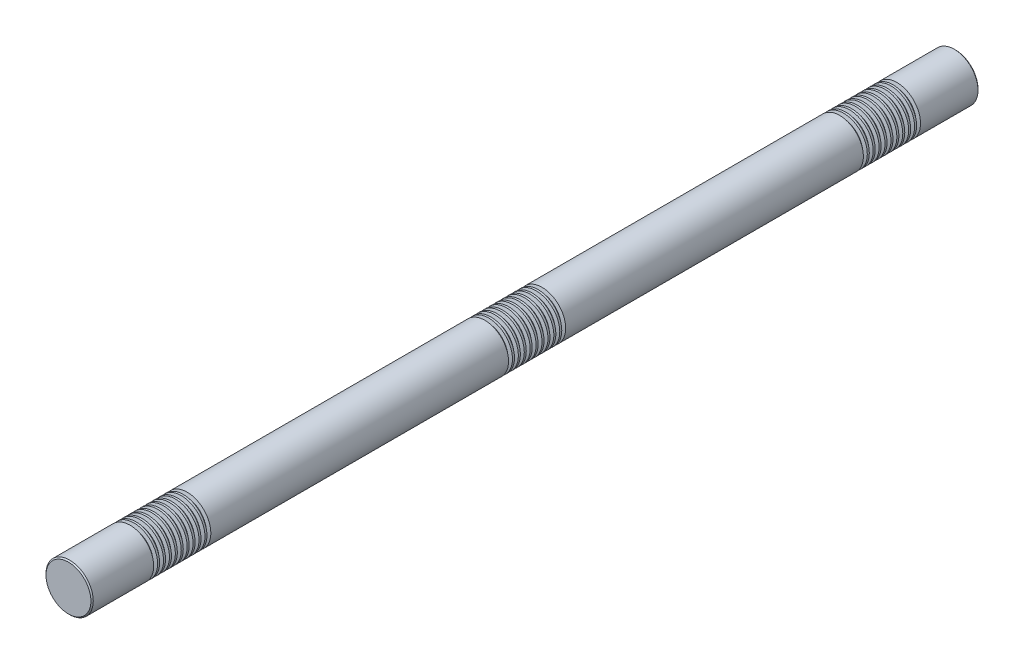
ISO-10303-21;
HEADER;
FILE_DESCRIPTION(('STEP AP214'),'2;1');
FILE_NAME('part.step','',(''),(''),'','','');
FILE_SCHEMA(('AUTOMOTIVE_DESIGN { 1 0 10303 214 1 1 1 1 }'));
ENDSEC;
DATA;
#1=APPLICATION_CONTEXT('core data for automotive mechanical design processes');
#2=APPLICATION_PROTOCOL_DEFINITION('international standard','automotive_design',2000,#1);
#3=PRODUCT_CONTEXT('',#1,'mechanical');
#4=PRODUCT('Part','Part','',(#3));
#5=PRODUCT_RELATED_PRODUCT_CATEGORY('part','',(#4));
#6=PRODUCT_DEFINITION_FORMATION('','',#4);
#7=PRODUCT_DEFINITION_CONTEXT('part definition',#1,'design');
#8=PRODUCT_DEFINITION('design','',#6,#7);
#9=PRODUCT_DEFINITION_SHAPE('','',#8);
#10=(LENGTH_UNIT() NAMED_UNIT(*) SI_UNIT(.MILLI.,.METRE.));
#11=(NAMED_UNIT(*) PLANE_ANGLE_UNIT() SI_UNIT($,.RADIAN.));
#12=(NAMED_UNIT(*) SI_UNIT($,.STERADIAN.) SOLID_ANGLE_UNIT());
#13=UNCERTAINTY_MEASURE_WITH_UNIT(LENGTH_MEASURE(1.E-05),#10,'distance_accuracy_value','');
#14=(GEOMETRIC_REPRESENTATION_CONTEXT(3) GLOBAL_UNCERTAINTY_ASSIGNED_CONTEXT((#13)) GLOBAL_UNIT_ASSIGNED_CONTEXT((#10,
#11,#12)) REPRESENTATION_CONTEXT('',''));
#15=CARTESIAN_POINT('',(0.,0.,0.));
#16=DIRECTION('',(0.,0.,1.));
#17=DIRECTION('',(1.,0.,0.));
#18=AXIS2_PLACEMENT_3D('',#15,#16,#17);
#19=CARTESIAN_POINT('',(0.,0.,750.));
#20=DIRECTION('',(0.,0.,-1.));
#21=DIRECTION('',(-1.,0.,0.));
#22=AXIS2_PLACEMENT_3D('',#19,#20,#21);
#23=CYLINDRICAL_SURFACE('',#22,40.);
#24=CARTESIAN_POINT('',(0.,0.,635.803847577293));
#25=DIRECTION('',(0.,0.,1.));
#26=DIRECTION('',(1.,0.,0.));
#27=AXIS2_PLACEMENT_3D('',#24,#25,#26);
#28=CIRCLE('',#27,40.);
#29=CARTESIAN_POINT('',(40.,0.,635.803847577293));
#30=VERTEX_POINT('',#29);
#31=EDGE_CURVE('E513',#30,#30,#28,.T.);
#32=ORIENTED_EDGE('',*,*,#31,.T.);
#33=EDGE_LOOP('',(#32));
#34=FACE_BOUND('',#33,.T.);
#35=CARTESIAN_POINT('',(0.,0.,639.196152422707));
#36=DIRECTION('',(0.,0.,1.));
#37=DIRECTION('',(1.,0.,0.));
#38=AXIS2_PLACEMENT_3D('',#35,#36,#37);
#39=CIRCLE('',#38,40.);
#40=CARTESIAN_POINT('',(40.,0.,639.196152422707));
#41=VERTEX_POINT('',#40);
#42=EDGE_CURVE('E525',#41,#41,#39,.T.);
#43=ORIENTED_EDGE('',*,*,#42,.F.);
#44=EDGE_LOOP('',(#43));
#45=FACE_BOUND('',#44,.T.);
#46=ADVANCED_FACE('F37',(#34,#45),#23,.T.);
#47=CARTESIAN_POINT('',(0.,0.,625.803847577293));
#48=DIRECTION('',(0.,0.,1.));
#49=DIRECTION('',(1.,0.,0.));
#50=AXIS2_PLACEMENT_3D('',#47,#48,#49);
#51=CIRCLE('',#50,40.);
#52=CARTESIAN_POINT('',(40.,0.,625.803847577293));
#53=VERTEX_POINT('',#52);
#54=EDGE_CURVE('E497',#53,#53,#51,.T.);
#55=ORIENTED_EDGE('',*,*,#54,.T.);
#56=EDGE_LOOP('',(#55));
#57=FACE_BOUND('',#56,.T.);
#58=CARTESIAN_POINT('',(0.,0.,629.196152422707));
#59=DIRECTION('',(0.,0.,1.));
#60=DIRECTION('',(1.,0.,0.));
#61=AXIS2_PLACEMENT_3D('',#58,#59,#60);
#62=CIRCLE('',#61,40.);
#63=CARTESIAN_POINT('',(40.,0.,629.196152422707));
#64=VERTEX_POINT('',#63);
#65=EDGE_CURVE('E509',#64,#64,#62,.T.);
#66=ORIENTED_EDGE('',*,*,#65,.F.);
#67=EDGE_LOOP('',(#66));
#68=FACE_BOUND('',#67,.T.);
#69=ADVANCED_FACE('F561',(#57,#68),#23,.T.);
#70=CARTESIAN_POINT('',(0.,0.,615.803847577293));
#71=DIRECTION('',(0.,0.,1.));
#72=DIRECTION('',(1.,0.,0.));
#73=AXIS2_PLACEMENT_3D('',#70,#71,#72);
#74=CIRCLE('',#73,40.);
#75=CARTESIAN_POINT('',(40.,0.,615.803847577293));
#76=VERTEX_POINT('',#75);
#77=EDGE_CURVE('E481',#76,#76,#74,.T.);
#78=ORIENTED_EDGE('',*,*,#77,.T.);
#79=EDGE_LOOP('',(#78));
#80=FACE_BOUND('',#79,.T.);
#81=CARTESIAN_POINT('',(0.,0.,619.196152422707));
#82=DIRECTION('',(0.,0.,1.));
#83=DIRECTION('',(1.,0.,0.));
#84=AXIS2_PLACEMENT_3D('',#81,#82,#83);
#85=CIRCLE('',#84,40.);
#86=CARTESIAN_POINT('',(40.,0.,619.196152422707));
#87=VERTEX_POINT('',#86);
#88=EDGE_CURVE('E493',#87,#87,#85,.T.);
#89=ORIENTED_EDGE('',*,*,#88,.F.);
#90=EDGE_LOOP('',(#89));
#91=FACE_BOUND('',#90,.T.);
#92=ADVANCED_FACE('F569',(#80,#91),#23,.T.);
#93=CARTESIAN_POINT('',(0.,0.,605.803847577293));
#94=DIRECTION('',(0.,0.,1.));
#95=DIRECTION('',(1.,0.,0.));
#96=AXIS2_PLACEMENT_3D('',#93,#94,#95);
#97=CIRCLE('',#96,40.);
#98=CARTESIAN_POINT('',(40.,0.,605.803847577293));
#99=VERTEX_POINT('',#98);
#100=EDGE_CURVE('E466',#99,#99,#97,.T.);
#101=ORIENTED_EDGE('',*,*,#100,.T.);
#102=EDGE_LOOP('',(#101));
#103=FACE_BOUND('',#102,.T.);
#104=CARTESIAN_POINT('',(0.,0.,609.196152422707));
#105=DIRECTION('',(0.,0.,1.));
#106=DIRECTION('',(1.,0.,0.));
#107=AXIS2_PLACEMENT_3D('',#104,#105,#106);
#108=CIRCLE('',#107,40.);
#109=CARTESIAN_POINT('',(40.,0.,609.196152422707));
#110=VERTEX_POINT('',#109);
#111=EDGE_CURVE('E477',#110,#110,#108,.T.);
#112=ORIENTED_EDGE('',*,*,#111,.F.);
#113=EDGE_LOOP('',(#112));
#114=FACE_BOUND('',#113,.T.);
#115=ADVANCED_FACE('F1162',(#103,#114),#23,.T.);
#116=CARTESIAN_POINT('',(0.,0.,595.803847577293));
#117=DIRECTION('',(0.,0.,1.));
#118=DIRECTION('',(1.,0.,0.));
#119=AXIS2_PLACEMENT_3D('',#116,#117,#118);
#120=CIRCLE('',#119,40.);
#121=CARTESIAN_POINT('',(40.,0.,595.803847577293));
#122=VERTEX_POINT('',#121);
#123=EDGE_CURVE('E450',#122,#122,#120,.T.);
#124=ORIENTED_EDGE('',*,*,#123,.T.);
#125=EDGE_LOOP('',(#124));
#126=FACE_BOUND('',#125,.T.);
#127=CARTESIAN_POINT('',(0.,0.,599.196152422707));
#128=DIRECTION('',(0.,0.,1.));
#129=DIRECTION('',(1.,0.,0.));
#130=AXIS2_PLACEMENT_3D('',#127,#128,#129);
#131=CIRCLE('',#130,40.);
#132=CARTESIAN_POINT('',(40.,0.,599.196152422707));
#133=VERTEX_POINT('',#132);
#134=EDGE_CURVE('E462',#133,#133,#131,.T.);
#135=ORIENTED_EDGE('',*,*,#134,.F.);
#136=EDGE_LOOP('',(#135));
#137=FACE_BOUND('',#136,.T.);
#138=ADVANCED_FACE('F1139',(#126,#137),#23,.T.);
#139=CARTESIAN_POINT('',(0.,0.,585.803847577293));
#140=DIRECTION('',(0.,0.,1.));
#141=DIRECTION('',(1.,0.,0.));
#142=AXIS2_PLACEMENT_3D('',#139,#140,#141);
#143=CIRCLE('',#142,40.);
#144=CARTESIAN_POINT('',(40.,0.,585.803847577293));
#145=VERTEX_POINT('',#144);
#146=EDGE_CURVE('E434',#145,#145,#143,.T.);
#147=ORIENTED_EDGE('',*,*,#146,.T.);
#148=EDGE_LOOP('',(#147));
#149=FACE_BOUND('',#148,.T.);
#150=CARTESIAN_POINT('',(0.,0.,589.196152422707));
#151=DIRECTION('',(0.,0.,1.));
#152=DIRECTION('',(1.,0.,0.));
#153=AXIS2_PLACEMENT_3D('',#150,#151,#152);
#154=CIRCLE('',#153,40.);
#155=CARTESIAN_POINT('',(40.,0.,589.196152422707));
#156=VERTEX_POINT('',#155);
#157=EDGE_CURVE('E446',#156,#156,#154,.T.);
#158=ORIENTED_EDGE('',*,*,#157,.F.);
#159=EDGE_LOOP('',(#158));
#160=FACE_BOUND('',#159,.T.);
#161=ADVANCED_FACE('F1116',(#149,#160),#23,.T.);
#162=CARTESIAN_POINT('',(0.,0.,575.803847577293));
#163=DIRECTION('',(0.,0.,1.));
#164=DIRECTION('',(1.,0.,0.));
#165=AXIS2_PLACEMENT_3D('',#162,#163,#164);
#166=CIRCLE('',#165,40.);
#167=CARTESIAN_POINT('',(40.,0.,575.803847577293));
#168=VERTEX_POINT('',#167);
#169=EDGE_CURVE('E418',#168,#168,#166,.T.);
#170=ORIENTED_EDGE('',*,*,#169,.T.);
#171=EDGE_LOOP('',(#170));
#172=FACE_BOUND('',#171,.T.);
#173=CARTESIAN_POINT('',(0.,0.,579.196152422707));
#174=DIRECTION('',(0.,0.,1.));
#175=DIRECTION('',(1.,0.,0.));
#176=AXIS2_PLACEMENT_3D('',#173,#174,#175);
#177=CIRCLE('',#176,40.);
#178=CARTESIAN_POINT('',(40.,0.,579.196152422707));
#179=VERTEX_POINT('',#178);
#180=EDGE_CURVE('E430',#179,#179,#177,.T.);
#181=ORIENTED_EDGE('',*,*,#180,.F.);
#182=EDGE_LOOP('',(#181));
#183=FACE_BOUND('',#182,.T.);
#184=ADVANCED_FACE('F1093',(#172,#183),#23,.T.);
#185=CARTESIAN_POINT('',(0.,0.,565.803847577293));
#186=DIRECTION('',(0.,0.,1.));
#187=DIRECTION('',(1.,0.,0.));
#188=AXIS2_PLACEMENT_3D('',#185,#186,#187);
#189=CIRCLE('',#188,40.);
#190=CARTESIAN_POINT('',(40.,0.,565.803847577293));
#191=VERTEX_POINT('',#190);
#192=EDGE_CURVE('E402',#191,#191,#189,.T.);
#193=ORIENTED_EDGE('',*,*,#192,.T.);
#194=EDGE_LOOP('',(#193));
#195=FACE_BOUND('',#194,.T.);
#196=CARTESIAN_POINT('',(0.,0.,569.196152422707));
#197=DIRECTION('',(0.,0.,1.));
#198=DIRECTION('',(1.,0.,0.));
#199=AXIS2_PLACEMENT_3D('',#196,#197,#198);
#200=CIRCLE('',#199,40.);
#201=CARTESIAN_POINT('',(40.,0.,569.196152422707));
#202=VERTEX_POINT('',#201);
#203=EDGE_CURVE('E414',#202,#202,#200,.T.);
#204=ORIENTED_EDGE('',*,*,#203,.F.);
#205=EDGE_LOOP('',(#204));
#206=FACE_BOUND('',#205,.T.);
#207=ADVANCED_FACE('F1074',(#195,#206),#23,.T.);
#208=CARTESIAN_POINT('',(0.,0.,555.803847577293));
#209=DIRECTION('',(0.,0.,1.));
#210=DIRECTION('',(1.,0.,0.));
#211=AXIS2_PLACEMENT_3D('',#208,#209,#210);
#212=CIRCLE('',#211,40.);
#213=CARTESIAN_POINT('',(40.,0.,555.803847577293));
#214=VERTEX_POINT('',#213);
#215=EDGE_CURVE('E242',#214,#214,#212,.T.);
#216=ORIENTED_EDGE('',*,*,#215,.T.);
#217=EDGE_LOOP('',(#216));
#218=FACE_BOUND('',#217,.T.);
#219=CARTESIAN_POINT('',(0.,0.,559.196152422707));
#220=DIRECTION('',(0.,0.,1.));
#221=DIRECTION('',(1.,0.,0.));
#222=AXIS2_PLACEMENT_3D('',#219,#220,#221);
#223=CIRCLE('',#222,40.);
#224=CARTESIAN_POINT('',(40.,0.,559.196152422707));
#225=VERTEX_POINT('',#224);
#226=EDGE_CURVE('E398',#225,#225,#223,.T.);
#227=ORIENTED_EDGE('',*,*,#226,.F.);
#228=EDGE_LOOP('',(#227));
#229=FACE_BOUND('',#228,.T.);
#230=ADVANCED_FACE('F1023',(#218,#229),#23,.T.);
#231=CARTESIAN_POINT('',(0.,0.,35.803847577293));
#232=DIRECTION('',(0.,0.,1.));
#233=DIRECTION('',(1.,0.,0.));
#234=AXIS2_PLACEMENT_3D('',#231,#232,#233);
#235=CIRCLE('',#234,40.);
#236=CARTESIAN_POINT('',(40.,0.,35.803847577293));
#237=VERTEX_POINT('',#236);
#238=EDGE_CURVE('E370',#237,#237,#235,.T.);
#239=ORIENTED_EDGE('',*,*,#238,.T.);
#240=EDGE_LOOP('',(#239));
#241=FACE_BOUND('',#240,.T.);
#242=CARTESIAN_POINT('',(0.,0.,39.1961524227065));
#243=DIRECTION('',(0.,0.,1.));
#244=DIRECTION('',(1.,0.,0.));
#245=AXIS2_PLACEMENT_3D('',#242,#243,#244);
#246=CIRCLE('',#245,40.);
#247=CARTESIAN_POINT('',(40.,0.,39.1961524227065));
#248=VERTEX_POINT('',#247);
#249=EDGE_CURVE('E382',#248,#248,#246,.T.);
#250=ORIENTED_EDGE('',*,*,#249,.F.);
#251=EDGE_LOOP('',(#250));
#252=FACE_BOUND('',#251,.T.);
#253=ADVANCED_FACE('F999',(#241,#252),#23,.T.);
#254=CARTESIAN_POINT('',(0.,0.,25.803847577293));
#255=DIRECTION('',(0.,0.,1.));
#256=DIRECTION('',(1.,0.,0.));
#257=AXIS2_PLACEMENT_3D('',#254,#255,#256);
#258=CIRCLE('',#257,40.);
#259=CARTESIAN_POINT('',(40.,0.,25.803847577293));
#260=VERTEX_POINT('',#259);
#261=EDGE_CURVE('E354',#260,#260,#258,.T.);
#262=ORIENTED_EDGE('',*,*,#261,.T.);
#263=EDGE_LOOP('',(#262));
#264=FACE_BOUND('',#263,.T.);
#265=CARTESIAN_POINT('',(0.,0.,29.1961524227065));
#266=DIRECTION('',(0.,0.,1.));
#267=DIRECTION('',(1.,0.,0.));
#268=AXIS2_PLACEMENT_3D('',#265,#266,#267);
#269=CIRCLE('',#268,40.);
#270=CARTESIAN_POINT('',(40.,0.,29.1961524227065));
#271=VERTEX_POINT('',#270);
#272=EDGE_CURVE('E366',#271,#271,#269,.T.);
#273=ORIENTED_EDGE('',*,*,#272,.F.);
#274=EDGE_LOOP('',(#273));
#275=FACE_BOUND('',#274,.T.);
#276=ADVANCED_FACE('F976',(#264,#275),#23,.T.);
#277=CARTESIAN_POINT('',(0.,0.,15.803847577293));
#278=DIRECTION('',(0.,0.,1.));
#279=DIRECTION('',(1.,0.,0.));
#280=AXIS2_PLACEMENT_3D('',#277,#278,#279);
#281=CIRCLE('',#280,40.);
#282=CARTESIAN_POINT('',(40.,0.,15.803847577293));
#283=VERTEX_POINT('',#282);
#284=EDGE_CURVE('E338',#283,#283,#281,.T.);
#285=ORIENTED_EDGE('',*,*,#284,.T.);
#286=EDGE_LOOP('',(#285));
#287=FACE_BOUND('',#286,.T.);
#288=CARTESIAN_POINT('',(0.,0.,19.1961524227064));
#289=DIRECTION('',(0.,0.,1.));
#290=DIRECTION('',(1.,0.,0.));
#291=AXIS2_PLACEMENT_3D('',#288,#289,#290);
#292=CIRCLE('',#291,40.);
#293=CARTESIAN_POINT('',(40.,0.,19.1961524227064));
#294=VERTEX_POINT('',#293);
#295=EDGE_CURVE('E350',#294,#294,#292,.T.);
#296=ORIENTED_EDGE('',*,*,#295,.F.);
#297=EDGE_LOOP('',(#296));
#298=FACE_BOUND('',#297,.T.);
#299=ADVANCED_FACE('F953',(#287,#298),#23,.T.);
#300=CARTESIAN_POINT('',(0.,0.,5.80384757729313));
#301=DIRECTION('',(0.,0.,1.));
#302=DIRECTION('',(1.,0.,0.));
#303=AXIS2_PLACEMENT_3D('',#300,#301,#302);
#304=CIRCLE('',#303,40.);
#305=CARTESIAN_POINT('',(40.,0.,5.80384757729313));
#306=VERTEX_POINT('',#305);
#307=EDGE_CURVE('E322',#306,#306,#304,.T.);
#308=ORIENTED_EDGE('',*,*,#307,.T.);
#309=EDGE_LOOP('',(#308));
#310=FACE_BOUND('',#309,.T.);
#311=CARTESIAN_POINT('',(0.,0.,9.19615242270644));
#312=DIRECTION('',(0.,0.,1.));
#313=DIRECTION('',(1.,0.,0.));
#314=AXIS2_PLACEMENT_3D('',#311,#312,#313);
#315=CIRCLE('',#314,40.);
#316=CARTESIAN_POINT('',(40.,0.,9.19615242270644));
#317=VERTEX_POINT('',#316);
#318=EDGE_CURVE('E334',#317,#317,#315,.T.);
#319=ORIENTED_EDGE('',*,*,#318,.F.);
#320=EDGE_LOOP('',(#319));
#321=FACE_BOUND('',#320,.T.);
#322=ADVANCED_FACE('F930',(#310,#321),#23,.T.);
#323=CARTESIAN_POINT('',(0.,0.,-4.19615242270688));
#324=DIRECTION('',(0.,0.,1.));
#325=DIRECTION('',(1.,0.,0.));
#326=AXIS2_PLACEMENT_3D('',#323,#324,#325);
#327=CIRCLE('',#326,40.);
#328=CARTESIAN_POINT('',(40.,0.,-4.19615242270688));
#329=VERTEX_POINT('',#328);
#330=EDGE_CURVE('E306',#329,#329,#327,.T.);
#331=ORIENTED_EDGE('',*,*,#330,.T.);
#332=EDGE_LOOP('',(#331));
#333=FACE_BOUND('',#332,.T.);
#334=CARTESIAN_POINT('',(0.,0.,-0.803847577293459));
#335=DIRECTION('',(0.,0.,1.));
#336=DIRECTION('',(1.,0.,0.));
#337=AXIS2_PLACEMENT_3D('',#334,#335,#336);
#338=CIRCLE('',#337,40.);
#339=CARTESIAN_POINT('',(40.,0.,-0.803847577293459));
#340=VERTEX_POINT('',#339);
#341=EDGE_CURVE('E318',#340,#340,#338,.T.);
#342=ORIENTED_EDGE('',*,*,#341,.F.);
#343=EDGE_LOOP('',(#342));
#344=FACE_BOUND('',#343,.T.);
#345=ADVANCED_FACE('F907',(#333,#344),#23,.T.);
#346=CARTESIAN_POINT('',(0.,0.,-14.1961524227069));
#347=DIRECTION('',(0.,0.,1.));
#348=DIRECTION('',(1.,0.,0.));
#349=AXIS2_PLACEMENT_3D('',#346,#347,#348);
#350=CIRCLE('',#349,40.);
#351=CARTESIAN_POINT('',(40.,0.,-14.1961524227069));
#352=VERTEX_POINT('',#351);
#353=EDGE_CURVE('E290',#352,#352,#350,.T.);
#354=ORIENTED_EDGE('',*,*,#353,.T.);
#355=EDGE_LOOP('',(#354));
#356=FACE_BOUND('',#355,.T.);
#357=CARTESIAN_POINT('',(0.,0.,-10.8038475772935));
#358=DIRECTION('',(0.,0.,1.));
#359=DIRECTION('',(1.,0.,0.));
#360=AXIS2_PLACEMENT_3D('',#357,#358,#359);
#361=CIRCLE('',#360,40.);
#362=CARTESIAN_POINT('',(40.,0.,-10.8038475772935));
#363=VERTEX_POINT('',#362);
#364=EDGE_CURVE('E302',#363,#363,#361,.T.);
#365=ORIENTED_EDGE('',*,*,#364,.F.);
#366=EDGE_LOOP('',(#365));
#367=FACE_BOUND('',#366,.T.);
#368=ADVANCED_FACE('F884',(#356,#367),#23,.T.);
#369=CARTESIAN_POINT('',(0.,0.,-24.1961524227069));
#370=DIRECTION('',(0.,0.,1.));
#371=DIRECTION('',(1.,0.,0.));
#372=AXIS2_PLACEMENT_3D('',#369,#370,#371);
#373=CIRCLE('',#372,40.);
#374=CARTESIAN_POINT('',(40.,0.,-24.1961524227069));
#375=VERTEX_POINT('',#374);
#376=EDGE_CURVE('E274',#375,#375,#373,.T.);
#377=ORIENTED_EDGE('',*,*,#376,.T.);
#378=EDGE_LOOP('',(#377));
#379=FACE_BOUND('',#378,.T.);
#380=CARTESIAN_POINT('',(0.,0.,-20.8038475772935));
#381=DIRECTION('',(0.,0.,1.));
#382=DIRECTION('',(1.,0.,0.));
#383=AXIS2_PLACEMENT_3D('',#380,#381,#382);
#384=CIRCLE('',#383,40.);
#385=CARTESIAN_POINT('',(40.,0.,-20.8038475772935));
#386=VERTEX_POINT('',#385);
#387=EDGE_CURVE('E286',#386,#386,#384,.T.);
#388=ORIENTED_EDGE('',*,*,#387,.F.);
#389=EDGE_LOOP('',(#388));
#390=FACE_BOUND('',#389,.T.);
#391=ADVANCED_FACE('F861',(#379,#390),#23,.T.);
#392=CARTESIAN_POINT('',(0.,0.,-34.1961524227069));
#393=DIRECTION('',(0.,0.,1.));
#394=DIRECTION('',(1.,0.,0.));
#395=AXIS2_PLACEMENT_3D('',#392,#393,#394);
#396=CIRCLE('',#395,40.);
#397=CARTESIAN_POINT('',(40.,0.,-34.1961524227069));
#398=VERTEX_POINT('',#397);
#399=EDGE_CURVE('E258',#398,#398,#396,.T.);
#400=ORIENTED_EDGE('',*,*,#399,.T.);
#401=EDGE_LOOP('',(#400));
#402=FACE_BOUND('',#401,.T.);
#403=CARTESIAN_POINT('',(0.,0.,-30.8038475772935));
#404=DIRECTION('',(0.,0.,1.));
#405=DIRECTION('',(1.,0.,0.));
#406=AXIS2_PLACEMENT_3D('',#403,#404,#405);
#407=CIRCLE('',#406,40.);
#408=CARTESIAN_POINT('',(40.,0.,-30.8038475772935));
#409=VERTEX_POINT('',#408);
#410=EDGE_CURVE('E270',#409,#409,#407,.T.);
#411=ORIENTED_EDGE('',*,*,#410,.F.);
#412=EDGE_LOOP('',(#411));
#413=FACE_BOUND('',#412,.T.);
#414=ADVANCED_FACE('F838',(#402,#413),#23,.T.);
#415=CARTESIAN_POINT('',(0.,0.,-44.1961524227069));
#416=DIRECTION('',(0.,0.,1.));
#417=DIRECTION('',(1.,0.,0.));
#418=AXIS2_PLACEMENT_3D('',#415,#416,#417);
#419=CIRCLE('',#418,40.);
#420=CARTESIAN_POINT('',(40.,0.,-44.1961524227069));
#421=VERTEX_POINT('',#420);
#422=EDGE_CURVE('E227',#421,#421,#419,.T.);
#423=ORIENTED_EDGE('',*,*,#422,.T.);
#424=EDGE_LOOP('',(#423));
#425=FACE_BOUND('',#424,.T.);
#426=CARTESIAN_POINT('',(0.,0.,-40.8038475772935));
#427=DIRECTION('',(0.,0.,1.));
#428=DIRECTION('',(1.,0.,0.));
#429=AXIS2_PLACEMENT_3D('',#426,#427,#428);
#430=CIRCLE('',#429,40.);
#431=CARTESIAN_POINT('',(40.,0.,-40.8038475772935));
#432=VERTEX_POINT('',#431);
#433=EDGE_CURVE('E254',#432,#432,#430,.T.);
#434=ORIENTED_EDGE('',*,*,#433,.F.);
#435=EDGE_LOOP('',(#434));
#436=FACE_BOUND('',#435,.T.);
#437=ADVANCED_FACE('F815',(#425,#436),#23,.T.);
#438=CARTESIAN_POINT('',(0.,0.,-554.196152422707));
#439=DIRECTION('',(0.,0.,1.));
#440=DIRECTION('',(1.,0.,0.));
#441=AXIS2_PLACEMENT_3D('',#438,#439,#440);
#442=CIRCLE('',#441,40.);
#443=CARTESIAN_POINT('',(40.,0.,-554.196152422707));
#444=VERTEX_POINT('',#443);
#445=EDGE_CURVE('E211',#444,#444,#442,.T.);
#446=ORIENTED_EDGE('',*,*,#445,.T.);
#447=EDGE_LOOP('',(#446));
#448=FACE_BOUND('',#447,.T.);
#449=CARTESIAN_POINT('',(0.,0.,-50.8038475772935));
#450=DIRECTION('',(0.,0.,1.));
#451=DIRECTION('',(1.,0.,0.));
#452=AXIS2_PLACEMENT_3D('',#449,#450,#451);
#453=CIRCLE('',#452,40.);
#454=CARTESIAN_POINT('',(40.,0.,-50.8038475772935));
#455=VERTEX_POINT('',#454);
#456=EDGE_CURVE('E223',#455,#455,#453,.T.);
#457=ORIENTED_EDGE('',*,*,#456,.F.);
#458=EDGE_LOOP('',(#457));
#459=FACE_BOUND('',#458,.T.);
#460=ADVANCED_FACE('F792',(#448,#459),#23,.T.);
#461=CARTESIAN_POINT('',(0.,0.,-564.196152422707));
#462=DIRECTION('',(0.,0.,1.));
#463=DIRECTION('',(1.,0.,0.));
#464=AXIS2_PLACEMENT_3D('',#461,#462,#463);
#465=CIRCLE('',#464,40.);
#466=CARTESIAN_POINT('',(40.,0.,-564.196152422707));
#467=VERTEX_POINT('',#466);
#468=EDGE_CURVE('E195',#467,#467,#465,.T.);
#469=ORIENTED_EDGE('',*,*,#468,.T.);
#470=EDGE_LOOP('',(#469));
#471=FACE_BOUND('',#470,.T.);
#472=CARTESIAN_POINT('',(0.,0.,-560.803847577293));
#473=DIRECTION('',(0.,0.,1.));
#474=DIRECTION('',(1.,0.,0.));
#475=AXIS2_PLACEMENT_3D('',#472,#473,#474);
#476=CIRCLE('',#475,40.);
#477=CARTESIAN_POINT('',(40.,0.,-560.803847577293));
#478=VERTEX_POINT('',#477);
#479=EDGE_CURVE('E207',#478,#478,#476,.T.);
#480=ORIENTED_EDGE('',*,*,#479,.F.);
#481=EDGE_LOOP('',(#480));
#482=FACE_BOUND('',#481,.T.);
#483=ADVANCED_FACE('F769',(#471,#482),#23,.T.);
#484=CARTESIAN_POINT('',(0.,0.,-574.196152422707));
#485=DIRECTION('',(0.,0.,1.));
#486=DIRECTION('',(1.,0.,0.));
#487=AXIS2_PLACEMENT_3D('',#484,#485,#486);
#488=CIRCLE('',#487,40.);
#489=CARTESIAN_POINT('',(40.,0.,-574.196152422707));
#490=VERTEX_POINT('',#489);
#491=EDGE_CURVE('E179',#490,#490,#488,.T.);
#492=ORIENTED_EDGE('',*,*,#491,.T.);
#493=EDGE_LOOP('',(#492));
#494=FACE_BOUND('',#493,.T.);
#495=CARTESIAN_POINT('',(0.,0.,-570.803847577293));
#496=DIRECTION('',(0.,0.,1.));
#497=DIRECTION('',(1.,0.,0.));
#498=AXIS2_PLACEMENT_3D('',#495,#496,#497);
#499=CIRCLE('',#498,40.);
#500=CARTESIAN_POINT('',(40.,0.,-570.803847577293));
#501=VERTEX_POINT('',#500);
#502=EDGE_CURVE('E191',#501,#501,#499,.T.);
#503=ORIENTED_EDGE('',*,*,#502,.F.);
#504=EDGE_LOOP('',(#503));
#505=FACE_BOUND('',#504,.T.);
#506=ADVANCED_FACE('F746',(#494,#505),#23,.T.);
#507=CARTESIAN_POINT('',(0.,0.,-584.196152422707));
#508=DIRECTION('',(0.,0.,1.));
#509=DIRECTION('',(1.,0.,0.));
#510=AXIS2_PLACEMENT_3D('',#507,#508,#509);
#511=CIRCLE('',#510,40.);
#512=CARTESIAN_POINT('',(40.,0.,-584.196152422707));
#513=VERTEX_POINT('',#512);
#514=EDGE_CURVE('E163',#513,#513,#511,.T.);
#515=ORIENTED_EDGE('',*,*,#514,.T.);
#516=EDGE_LOOP('',(#515));
#517=FACE_BOUND('',#516,.T.);
#518=CARTESIAN_POINT('',(0.,0.,-580.803847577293));
#519=DIRECTION('',(0.,0.,1.));
#520=DIRECTION('',(1.,0.,0.));
#521=AXIS2_PLACEMENT_3D('',#518,#519,#520);
#522=CIRCLE('',#521,40.);
#523=CARTESIAN_POINT('',(40.,0.,-580.803847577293));
#524=VERTEX_POINT('',#523);
#525=EDGE_CURVE('E175',#524,#524,#522,.T.);
#526=ORIENTED_EDGE('',*,*,#525,.F.);
#527=EDGE_LOOP('',(#526));
#528=FACE_BOUND('',#527,.T.);
#529=ADVANCED_FACE('F723',(#517,#528),#23,.T.);
#530=CARTESIAN_POINT('',(0.,0.,-594.196152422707));
#531=DIRECTION('',(0.,0.,1.));
#532=DIRECTION('',(1.,0.,0.));
#533=AXIS2_PLACEMENT_3D('',#530,#531,#532);
#534=CIRCLE('',#533,40.);
#535=CARTESIAN_POINT('',(40.,0.,-594.196152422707));
#536=VERTEX_POINT('',#535);
#537=EDGE_CURVE('E147',#536,#536,#534,.T.);
#538=ORIENTED_EDGE('',*,*,#537,.T.);
#539=EDGE_LOOP('',(#538));
#540=FACE_BOUND('',#539,.T.);
#541=CARTESIAN_POINT('',(0.,0.,-590.803847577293));
#542=DIRECTION('',(0.,0.,1.));
#543=DIRECTION('',(1.,0.,0.));
#544=AXIS2_PLACEMENT_3D('',#541,#542,#543);
#545=CIRCLE('',#544,40.);
#546=CARTESIAN_POINT('',(40.,0.,-590.803847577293));
#547=VERTEX_POINT('',#546);
#548=EDGE_CURVE('E159',#547,#547,#545,.T.);
#549=ORIENTED_EDGE('',*,*,#548,.F.);
#550=EDGE_LOOP('',(#549));
#551=FACE_BOUND('',#550,.T.);
#552=ADVANCED_FACE('F700',(#540,#551),#23,.T.);
#553=CARTESIAN_POINT('',(0.,0.,-604.196152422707));
#554=DIRECTION('',(0.,0.,1.));
#555=DIRECTION('',(1.,0.,0.));
#556=AXIS2_PLACEMENT_3D('',#553,#554,#555);
#557=CIRCLE('',#556,40.);
#558=CARTESIAN_POINT('',(40.,0.,-604.196152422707));
#559=VERTEX_POINT('',#558);
#560=EDGE_CURVE('E131',#559,#559,#557,.T.);
#561=ORIENTED_EDGE('',*,*,#560,.T.);
#562=EDGE_LOOP('',(#561));
#563=FACE_BOUND('',#562,.T.);
#564=CARTESIAN_POINT('',(0.,0.,-600.803847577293));
#565=DIRECTION('',(0.,0.,1.));
#566=DIRECTION('',(1.,0.,0.));
#567=AXIS2_PLACEMENT_3D('',#564,#565,#566);
#568=CIRCLE('',#567,40.);
#569=CARTESIAN_POINT('',(40.,0.,-600.803847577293));
#570=VERTEX_POINT('',#569);
#571=EDGE_CURVE('E143',#570,#570,#568,.T.);
#572=ORIENTED_EDGE('',*,*,#571,.F.);
#573=EDGE_LOOP('',(#572));
#574=FACE_BOUND('',#573,.T.);
#575=ADVANCED_FACE('F677',(#563,#574),#23,.T.);
#576=CARTESIAN_POINT('',(0.,0.,-614.196152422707));
#577=DIRECTION('',(0.,0.,1.));
#578=DIRECTION('',(1.,0.,0.));
#579=AXIS2_PLACEMENT_3D('',#576,#577,#578);
#580=CIRCLE('',#579,40.);
#581=CARTESIAN_POINT('',(40.,0.,-614.196152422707));
#582=VERTEX_POINT('',#581);
#583=EDGE_CURVE('E116',#582,#582,#580,.T.);
#584=ORIENTED_EDGE('',*,*,#583,.T.);
#585=EDGE_LOOP('',(#584));
#586=FACE_BOUND('',#585,.T.);
#587=CARTESIAN_POINT('',(0.,0.,-610.803847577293));
#588=DIRECTION('',(0.,0.,1.));
#589=DIRECTION('',(1.,0.,0.));
#590=AXIS2_PLACEMENT_3D('',#587,#588,#589);
#591=CIRCLE('',#590,40.);
#592=CARTESIAN_POINT('',(40.,0.,-610.803847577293));
#593=VERTEX_POINT('',#592);
#594=EDGE_CURVE('E127',#593,#593,#591,.T.);
#595=ORIENTED_EDGE('',*,*,#594,.F.);
#596=EDGE_LOOP('',(#595));
#597=FACE_BOUND('',#596,.T.);
#598=ADVANCED_FACE('F654',(#586,#597),#23,.T.);
#599=CARTESIAN_POINT('',(0.,0.,-624.196152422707));
#600=DIRECTION('',(0.,0.,1.));
#601=DIRECTION('',(1.,0.,0.));
#602=AXIS2_PLACEMENT_3D('',#599,#600,#601);
#603=CIRCLE('',#602,40.);
#604=CARTESIAN_POINT('',(40.,0.,-624.196152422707));
#605=VERTEX_POINT('',#604);
#606=EDGE_CURVE('E100',#605,#605,#603,.T.);
#607=ORIENTED_EDGE('',*,*,#606,.T.);
#608=EDGE_LOOP('',(#607));
#609=FACE_BOUND('',#608,.T.);
#610=CARTESIAN_POINT('',(0.,0.,-620.803847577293));
#611=DIRECTION('',(0.,0.,1.));
#612=DIRECTION('',(1.,0.,0.));
#613=AXIS2_PLACEMENT_3D('',#610,#611,#612);
#614=CIRCLE('',#613,40.);
#615=CARTESIAN_POINT('',(40.,0.,-620.803847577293));
#616=VERTEX_POINT('',#615);
#617=EDGE_CURVE('E112',#616,#616,#614,.T.);
#618=ORIENTED_EDGE('',*,*,#617,.F.);
#619=EDGE_LOOP('',(#618));
#620=FACE_BOUND('',#619,.T.);
#621=ADVANCED_FACE('F631',(#609,#620),#23,.T.);
#622=CARTESIAN_POINT('',(0.,0.,-634.196152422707));
#623=DIRECTION('',(0.,0.,1.));
#624=DIRECTION('',(1.,0.,0.));
#625=AXIS2_PLACEMENT_3D('',#622,#623,#624);
#626=CIRCLE('',#625,40.);
#627=CARTESIAN_POINT('',(40.,0.,-634.196152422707));
#628=VERTEX_POINT('',#627);
#629=EDGE_CURVE('E84',#628,#628,#626,.T.);
#630=ORIENTED_EDGE('',*,*,#629,.T.);
#631=EDGE_LOOP('',(#630));
#632=FACE_BOUND('',#631,.T.);
#633=CARTESIAN_POINT('',(0.,0.,-630.803847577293));
#634=DIRECTION('',(0.,0.,1.));
#635=DIRECTION('',(1.,0.,0.));
#636=AXIS2_PLACEMENT_3D('',#633,#634,#635);
#637=CIRCLE('',#636,40.);
#638=CARTESIAN_POINT('',(40.,0.,-630.803847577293));
#639=VERTEX_POINT('',#638);
#640=EDGE_CURVE('E96',#639,#639,#637,.T.);
#641=ORIENTED_EDGE('',*,*,#640,.F.);
#642=EDGE_LOOP('',(#641));
#643=FACE_BOUND('',#642,.T.);
#644=ADVANCED_FACE('F584',(#632,#643),#23,.T.);
#645=CARTESIAN_POINT('',(0.,0.,-644.196152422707));
#646=DIRECTION('',(0.,0.,1.));
#647=DIRECTION('',(1.,0.,0.));
#648=AXIS2_PLACEMENT_3D('',#645,#646,#647);
#649=CIRCLE('',#648,40.);
#650=CARTESIAN_POINT('',(40.,0.,-644.196152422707));
#651=VERTEX_POINT('',#650);
#652=EDGE_CURVE('E69',#651,#651,#649,.T.);
#653=ORIENTED_EDGE('',*,*,#652,.T.);
#654=EDGE_LOOP('',(#653));
#655=FACE_BOUND('',#654,.T.);
#656=CARTESIAN_POINT('',(0.,0.,-640.803847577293));
#657=DIRECTION('',(0.,0.,1.));
#658=DIRECTION('',(1.,0.,0.));
#659=AXIS2_PLACEMENT_3D('',#656,#657,#658);
#660=CIRCLE('',#659,40.);
#661=CARTESIAN_POINT('',(40.,0.,-640.803847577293));
#662=VERTEX_POINT('',#661);
#663=EDGE_CURVE('E80',#662,#662,#660,.T.);
#664=ORIENTED_EDGE('',*,*,#663,.F.);
#665=EDGE_LOOP('',(#664));
#666=FACE_BOUND('',#665,.T.);
#667=ADVANCED_FACE('F577',(#655,#666),#23,.T.);
#668=CARTESIAN_POINT('',(0.,0.,-748.));
#669=DIRECTION('',(0.,0.,1.));
#670=DIRECTION('',(1.,0.,0.));
#671=AXIS2_PLACEMENT_3D('',#668,#669,#670);
#672=CIRCLE('',#671,40.);
#673=CARTESIAN_POINT('',(40.,0.,-748.));
#674=VERTEX_POINT('',#673);
#675=EDGE_CURVE('E52',#674,#674,#672,.T.);
#676=ORIENTED_EDGE('',*,*,#675,.T.);
#677=EDGE_LOOP('',(#676));
#678=FACE_BOUND('',#677,.T.);
#679=CARTESIAN_POINT('',(0.,0.,-650.803847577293));
#680=DIRECTION('',(0.,0.,1.));
#681=DIRECTION('',(1.,0.,0.));
#682=AXIS2_PLACEMENT_3D('',#679,#680,#681);
#683=CIRCLE('',#682,40.);
#684=CARTESIAN_POINT('',(40.,0.,-650.803847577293));
#685=VERTEX_POINT('',#684);
#686=EDGE_CURVE('E65',#685,#685,#683,.T.);
#687=ORIENTED_EDGE('',*,*,#686,.F.);
#688=EDGE_LOOP('',(#687));
#689=FACE_BOUND('',#688,.T.);
#690=ADVANCED_FACE('F565',(#678,#689),#23,.T.);
#691=CARTESIAN_POINT('',(0.,0.,-750.));
#692=DIRECTION('',(0.,0.,1.));
#693=DIRECTION('',(1.,0.,0.));
#694=AXIS2_PLACEMENT_3D('',#691,#692,#693);
#695=PLANE('',#694);
#696=CARTESIAN_POINT('',(0.,0.,-750.));
#697=DIRECTION('',(0.,0.,1.));
#698=DIRECTION('',(1.,0.,0.));
#699=AXIS2_PLACEMENT_3D('',#696,#697,#698);
#700=CIRCLE('',#699,38.);
#701=CARTESIAN_POINT('',(38.,0.,-750.));
#702=VERTEX_POINT('',#701);
#703=EDGE_CURVE('E45',#702,#702,#700,.F.);
#704=ORIENTED_EDGE('',*,*,#703,.T.);
#705=EDGE_LOOP('',(#704));
#706=FACE_BOUND('',#705,.T.);
#707=ADVANCED_FACE('F576',(#706),#695,.F.);
#708=CARTESIAN_POINT('',(0.,0.,-748.));
#709=DIRECTION('',(0.,0.,1.));
#710=DIRECTION('',(1.,0.,0.));
#711=AXIS2_PLACEMENT_3D('',#708,#709,#710);
#712=CONICAL_SURFACE('',#711,40.,0.785398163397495);
#713=ORIENTED_EDGE('',*,*,#703,.F.);
#714=EDGE_LOOP('',(#713));
#715=FACE_BOUND('',#714,.T.);
#716=ORIENTED_EDGE('',*,*,#675,.F.);
#717=EDGE_LOOP('',(#716));
#718=FACE_BOUND('',#717,.T.);
#719=ADVANCED_FACE('F583',(#715,#718),#712,.T.);
#720=CARTESIAN_POINT('',(0.,0.,-649.196152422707));
#721=DIRECTION('',(0.,0.,-1.));
#722=DIRECTION('',(-1.,0.,0.));
#723=AXIS2_PLACEMENT_3D('',#720,#721,#722);
#724=CONICAL_SURFACE('',#723,34.,1.30899693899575);
#725=ORIENTED_EDGE('',*,*,#686,.T.);
#726=EDGE_LOOP('',(#725));
#727=FACE_BOUND('',#726,.T.);
#728=CARTESIAN_POINT('',(0.,0.,-649.196152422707));
#729=DIRECTION('',(0.,0.,1.));
#730=DIRECTION('',(1.,0.,0.));
#731=AXIS2_PLACEMENT_3D('',#728,#729,#730);
#732=CIRCLE('',#731,34.);
#733=CARTESIAN_POINT('',(34.,0.,-649.196152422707));
#734=VERTEX_POINT('',#733);
#735=EDGE_CURVE('E76',#734,#734,#732,.T.);
#736=ORIENTED_EDGE('',*,*,#735,.F.);
#737=EDGE_LOOP('',(#736));
#738=FACE_BOUND('',#737,.T.);
#739=ADVANCED_FACE('F590',(#727,#738),#724,.T.);
#740=CARTESIAN_POINT('',(0.,0.,-644.196152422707));
#741=DIRECTION('',(0.,0.,1.));
#742=DIRECTION('',(1.,0.,0.));
#743=AXIS2_PLACEMENT_3D('',#740,#741,#742);
#744=CONICAL_SURFACE('',#743,40.,1.30899693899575);
#745=CARTESIAN_POINT('',(0.,0.,-645.803847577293));
#746=DIRECTION('',(0.,0.,1.));
#747=DIRECTION('',(1.,0.,0.));
#748=AXIS2_PLACEMENT_3D('',#745,#746,#747);
#749=CIRCLE('',#748,34.);
#750=CARTESIAN_POINT('',(34.,0.,-645.803847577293));
#751=VERTEX_POINT('',#750);
#752=EDGE_CURVE('E72',#751,#751,#749,.T.);
#753=ORIENTED_EDGE('',*,*,#752,.T.);
#754=EDGE_LOOP('',(#753));
#755=FACE_BOUND('',#754,.T.);
#756=ORIENTED_EDGE('',*,*,#652,.F.);
#757=EDGE_LOOP('',(#756));
#758=FACE_BOUND('',#757,.T.);
#759=ADVANCED_FACE('F593',(#755,#758),#744,.T.);
#760=CARTESIAN_POINT('',(0.,0.,748.));
#761=DIRECTION('',(0.,0.,1.));
#762=DIRECTION('',(1.,0.,0.));
#763=AXIS2_PLACEMENT_3D('',#760,#761,#762);
#764=CYLINDRICAL_SURFACE('',#763,34.);
#765=ORIENTED_EDGE('',*,*,#735,.T.);
#766=EDGE_LOOP('',(#765));
#767=FACE_BOUND('',#766,.T.);
#768=ORIENTED_EDGE('',*,*,#752,.F.);
#769=EDGE_LOOP('',(#768));
#770=FACE_BOUND('',#769,.T.);
#771=ADVANCED_FACE('F597',(#767,#770),#764,.T.);
#772=CARTESIAN_POINT('',(0.,0.,-639.196152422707));
#773=DIRECTION('',(0.,0.,-1.));
#774=DIRECTION('',(-1.,0.,0.));
#775=AXIS2_PLACEMENT_3D('',#772,#773,#774);
#776=CONICAL_SURFACE('',#775,34.,1.30899693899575);
#777=ORIENTED_EDGE('',*,*,#663,.T.);
#778=EDGE_LOOP('',(#777));
#779=FACE_BOUND('',#778,.T.);
#780=CARTESIAN_POINT('',(0.,0.,-639.196152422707));
#781=DIRECTION('',(0.,0.,1.));
#782=DIRECTION('',(1.,0.,0.));
#783=AXIS2_PLACEMENT_3D('',#780,#781,#782);
#784=CIRCLE('',#783,34.);
#785=CARTESIAN_POINT('',(34.,0.,-639.196152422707));
#786=VERTEX_POINT('',#785);
#787=EDGE_CURVE('E92',#786,#786,#784,.T.);
#788=ORIENTED_EDGE('',*,*,#787,.F.);
#789=EDGE_LOOP('',(#788));
#790=FACE_BOUND('',#789,.T.);
#791=ADVANCED_FACE('F600',(#779,#790),#776,.T.);
#792=CARTESIAN_POINT('',(0.,0.,-634.196152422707));
#793=DIRECTION('',(0.,0.,1.));
#794=DIRECTION('',(1.,0.,0.));
#795=AXIS2_PLACEMENT_3D('',#792,#793,#794);
#796=CONICAL_SURFACE('',#795,40.,1.30899693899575);
#797=CARTESIAN_POINT('',(0.,0.,-635.803847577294));
#798=DIRECTION('',(0.,0.,1.));
#799=DIRECTION('',(1.,0.,0.));
#800=AXIS2_PLACEMENT_3D('',#797,#798,#799);
#801=CIRCLE('',#800,34.);
#802=CARTESIAN_POINT('',(34.,0.,-635.803847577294));
#803=VERTEX_POINT('',#802);
#804=EDGE_CURVE('E88',#803,#803,#801,.T.);
#805=ORIENTED_EDGE('',*,*,#804,.T.);
#806=EDGE_LOOP('',(#805));
#807=FACE_BOUND('',#806,.T.);
#808=ORIENTED_EDGE('',*,*,#629,.F.);
#809=EDGE_LOOP('',(#808));
#810=FACE_BOUND('',#809,.T.);
#811=ADVANCED_FACE('F613',(#807,#810),#796,.T.);
#812=CARTESIAN_POINT('',(0.,0.,-640.803847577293));
#813=DIRECTION('',(0.,0.,1.));
#814=DIRECTION('',(1.,0.,0.));
#815=AXIS2_PLACEMENT_3D('',#812,#813,#814);
#816=CYLINDRICAL_SURFACE('',#815,34.);
#817=ORIENTED_EDGE('',*,*,#787,.T.);
#818=EDGE_LOOP('',(#817));
#819=FACE_BOUND('',#818,.T.);
#820=ORIENTED_EDGE('',*,*,#804,.F.);
#821=EDGE_LOOP('',(#820));
#822=FACE_BOUND('',#821,.T.);
#823=ADVANCED_FACE('F617',(#819,#822),#816,.T.);
#824=CARTESIAN_POINT('',(0.,0.,-629.196152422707));
#825=DIRECTION('',(0.,0.,-1.));
#826=DIRECTION('',(-1.,0.,0.));
#827=AXIS2_PLACEMENT_3D('',#824,#825,#826);
#828=CONICAL_SURFACE('',#827,34.,1.30899693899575);
#829=ORIENTED_EDGE('',*,*,#640,.T.);
#830=EDGE_LOOP('',(#829));
#831=FACE_BOUND('',#830,.T.);
#832=CARTESIAN_POINT('',(0.,0.,-629.196152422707));
#833=DIRECTION('',(0.,0.,1.));
#834=DIRECTION('',(1.,0.,0.));
#835=AXIS2_PLACEMENT_3D('',#832,#833,#834);
#836=CIRCLE('',#835,34.);
#837=CARTESIAN_POINT('',(34.,0.,-629.196152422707));
#838=VERTEX_POINT('',#837);
#839=EDGE_CURVE('E108',#838,#838,#836,.T.);
#840=ORIENTED_EDGE('',*,*,#839,.F.);
#841=EDGE_LOOP('',(#840));
#842=FACE_BOUND('',#841,.T.);
#843=ADVANCED_FACE('F620',(#831,#842),#828,.T.);
#844=CARTESIAN_POINT('',(0.,0.,-624.196152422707));
#845=DIRECTION('',(0.,0.,1.));
#846=DIRECTION('',(1.,0.,0.));
#847=AXIS2_PLACEMENT_3D('',#844,#845,#846);
#848=CONICAL_SURFACE('',#847,40.,1.30899693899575);
#849=CARTESIAN_POINT('',(0.,0.,-625.803847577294));
#850=DIRECTION('',(0.,0.,1.));
#851=DIRECTION('',(1.,0.,0.));
#852=AXIS2_PLACEMENT_3D('',#849,#850,#851);
#853=CIRCLE('',#852,34.);
#854=CARTESIAN_POINT('',(34.,0.,-625.803847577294));
#855=VERTEX_POINT('',#854);
#856=EDGE_CURVE('E104',#855,#855,#853,.T.);
#857=ORIENTED_EDGE('',*,*,#856,.T.);
#858=EDGE_LOOP('',(#857));
#859=FACE_BOUND('',#858,.T.);
#860=ORIENTED_EDGE('',*,*,#606,.F.);
#861=EDGE_LOOP('',(#860));
#862=FACE_BOUND('',#861,.T.);
#863=ADVANCED_FACE('F636',(#859,#862),#848,.T.);
#864=CARTESIAN_POINT('',(0.,0.,-630.803847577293));
#865=DIRECTION('',(0.,0.,1.));
#866=DIRECTION('',(1.,0.,0.));
#867=AXIS2_PLACEMENT_3D('',#864,#865,#866);
#868=CYLINDRICAL_SURFACE('',#867,34.);
#869=ORIENTED_EDGE('',*,*,#839,.T.);
#870=EDGE_LOOP('',(#869));
#871=FACE_BOUND('',#870,.T.);
#872=ORIENTED_EDGE('',*,*,#856,.F.);
#873=EDGE_LOOP('',(#872));
#874=FACE_BOUND('',#873,.T.);
#875=ADVANCED_FACE('F640',(#871,#874),#868,.T.);
#876=CARTESIAN_POINT('',(0.,0.,-619.196152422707));
#877=DIRECTION('',(0.,0.,-1.));
#878=DIRECTION('',(-1.,0.,0.));
#879=AXIS2_PLACEMENT_3D('',#876,#877,#878);
#880=CONICAL_SURFACE('',#879,34.,1.30899693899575);
#881=ORIENTED_EDGE('',*,*,#617,.T.);
#882=EDGE_LOOP('',(#881));
#883=FACE_BOUND('',#882,.T.);
#884=CARTESIAN_POINT('',(0.,0.,-619.196152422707));
#885=DIRECTION('',(0.,0.,1.));
#886=DIRECTION('',(1.,0.,0.));
#887=AXIS2_PLACEMENT_3D('',#884,#885,#886);
#888=CIRCLE('',#887,34.);
#889=CARTESIAN_POINT('',(34.,0.,-619.196152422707));
#890=VERTEX_POINT('',#889);
#891=EDGE_CURVE('E123',#890,#890,#888,.T.);
#892=ORIENTED_EDGE('',*,*,#891,.F.);
#893=EDGE_LOOP('',(#892));
#894=FACE_BOUND('',#893,.T.);
#895=ADVANCED_FACE('F643',(#883,#894),#880,.T.);
#896=CARTESIAN_POINT('',(0.,0.,-614.196152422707));
#897=DIRECTION('',(0.,0.,1.));
#898=DIRECTION('',(1.,0.,0.));
#899=AXIS2_PLACEMENT_3D('',#896,#897,#898);
#900=CONICAL_SURFACE('',#899,40.,1.30899693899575);
#901=CARTESIAN_POINT('',(0.,0.,-615.803847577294));
#902=DIRECTION('',(0.,0.,1.));
#903=DIRECTION('',(1.,0.,0.));
#904=AXIS2_PLACEMENT_3D('',#901,#902,#903);
#905=CIRCLE('',#904,34.);
#906=CARTESIAN_POINT('',(34.,0.,-615.803847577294));
#907=VERTEX_POINT('',#906);
#908=EDGE_CURVE('E120',#907,#907,#905,.T.);
#909=ORIENTED_EDGE('',*,*,#908,.T.);
#910=EDGE_LOOP('',(#909));
#911=FACE_BOUND('',#910,.T.);
#912=ORIENTED_EDGE('',*,*,#583,.F.);
#913=EDGE_LOOP('',(#912));
#914=FACE_BOUND('',#913,.T.);
#915=ADVANCED_FACE('F659',(#911,#914),#900,.T.);
#916=CARTESIAN_POINT('',(0.,0.,-620.803847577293));
#917=DIRECTION('',(0.,0.,1.));
#918=DIRECTION('',(1.,0.,0.));
#919=AXIS2_PLACEMENT_3D('',#916,#917,#918);
#920=CYLINDRICAL_SURFACE('',#919,34.);
#921=ORIENTED_EDGE('',*,*,#891,.T.);
#922=EDGE_LOOP('',(#921));
#923=FACE_BOUND('',#922,.T.);
#924=ORIENTED_EDGE('',*,*,#908,.F.);
#925=EDGE_LOOP('',(#924));
#926=FACE_BOUND('',#925,.T.);
#927=ADVANCED_FACE('F663',(#923,#926),#920,.T.);
#928=CARTESIAN_POINT('',(0.,0.,-609.196152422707));
#929=DIRECTION('',(0.,0.,-1.));
#930=DIRECTION('',(-1.,0.,0.));
#931=AXIS2_PLACEMENT_3D('',#928,#929,#930);
#932=CONICAL_SURFACE('',#931,34.,1.30899693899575);
#933=ORIENTED_EDGE('',*,*,#594,.T.);
#934=EDGE_LOOP('',(#933));
#935=FACE_BOUND('',#934,.T.);
#936=CARTESIAN_POINT('',(0.,0.,-609.196152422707));
#937=DIRECTION('',(0.,0.,1.));
#938=DIRECTION('',(1.,0.,0.));
#939=AXIS2_PLACEMENT_3D('',#936,#937,#938);
#940=CIRCLE('',#939,34.);
#941=CARTESIAN_POINT('',(34.,0.,-609.196152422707));
#942=VERTEX_POINT('',#941);
#943=EDGE_CURVE('E139',#942,#942,#940,.T.);
#944=ORIENTED_EDGE('',*,*,#943,.F.);
#945=EDGE_LOOP('',(#944));
#946=FACE_BOUND('',#945,.T.);
#947=ADVANCED_FACE('F666',(#935,#946),#932,.T.);
#948=CARTESIAN_POINT('',(0.,0.,-604.196152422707));
#949=DIRECTION('',(0.,0.,1.));
#950=DIRECTION('',(1.,0.,0.));
#951=AXIS2_PLACEMENT_3D('',#948,#949,#950);
#952=CONICAL_SURFACE('',#951,40.,1.30899693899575);
#953=CARTESIAN_POINT('',(0.,0.,-605.803847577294));
#954=DIRECTION('',(0.,0.,1.));
#955=DIRECTION('',(1.,0.,0.));
#956=AXIS2_PLACEMENT_3D('',#953,#954,#955);
#957=CIRCLE('',#956,34.);
#958=CARTESIAN_POINT('',(34.,0.,-605.803847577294));
#959=VERTEX_POINT('',#958);
#960=EDGE_CURVE('E135',#959,#959,#957,.T.);
#961=ORIENTED_EDGE('',*,*,#960,.T.);
#962=EDGE_LOOP('',(#961));
#963=FACE_BOUND('',#962,.T.);
#964=ORIENTED_EDGE('',*,*,#560,.F.);
#965=EDGE_LOOP('',(#964));
#966=FACE_BOUND('',#965,.T.);
#967=ADVANCED_FACE('F682',(#963,#966),#952,.T.);
#968=CARTESIAN_POINT('',(0.,0.,-610.803847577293));
#969=DIRECTION('',(0.,0.,1.));
#970=DIRECTION('',(1.,0.,0.));
#971=AXIS2_PLACEMENT_3D('',#968,#969,#970);
#972=CYLINDRICAL_SURFACE('',#971,34.);
#973=ORIENTED_EDGE('',*,*,#943,.T.);
#974=EDGE_LOOP('',(#973));
#975=FACE_BOUND('',#974,.T.);
#976=ORIENTED_EDGE('',*,*,#960,.F.);
#977=EDGE_LOOP('',(#976));
#978=FACE_BOUND('',#977,.T.);
#979=ADVANCED_FACE('F686',(#975,#978),#972,.T.);
#980=CARTESIAN_POINT('',(0.,0.,-599.196152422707));
#981=DIRECTION('',(0.,0.,-1.));
#982=DIRECTION('',(-1.,0.,0.));
#983=AXIS2_PLACEMENT_3D('',#980,#981,#982);
#984=CONICAL_SURFACE('',#983,34.,1.30899693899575);
#985=ORIENTED_EDGE('',*,*,#571,.T.);
#986=EDGE_LOOP('',(#985));
#987=FACE_BOUND('',#986,.T.);
#988=CARTESIAN_POINT('',(0.,0.,-599.196152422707));
#989=DIRECTION('',(0.,0.,1.));
#990=DIRECTION('',(1.,0.,0.));
#991=AXIS2_PLACEMENT_3D('',#988,#989,#990);
#992=CIRCLE('',#991,34.);
#993=CARTESIAN_POINT('',(34.,0.,-599.196152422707));
#994=VERTEX_POINT('',#993);
#995=EDGE_CURVE('E155',#994,#994,#992,.T.);
#996=ORIENTED_EDGE('',*,*,#995,.F.);
#997=EDGE_LOOP('',(#996));
#998=FACE_BOUND('',#997,.T.);
#999=ADVANCED_FACE('F689',(#987,#998),#984,.T.);
#1000=CARTESIAN_POINT('',(0.,0.,-594.196152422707));
#1001=DIRECTION('',(0.,0.,1.));
#1002=DIRECTION('',(1.,0.,0.));
#1003=AXIS2_PLACEMENT_3D('',#1000,#1001,#1002);
#1004=CONICAL_SURFACE('',#1003,40.,1.30899693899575);
#1005=CARTESIAN_POINT('',(0.,0.,-595.803847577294));
#1006=DIRECTION('',(0.,0.,1.));
#1007=DIRECTION('',(1.,0.,0.));
#1008=AXIS2_PLACEMENT_3D('',#1005,#1006,#1007);
#1009=CIRCLE('',#1008,34.);
#1010=CARTESIAN_POINT('',(34.,0.,-595.803847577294));
#1011=VERTEX_POINT('',#1010);
#1012=EDGE_CURVE('E151',#1011,#1011,#1009,.T.);
#1013=ORIENTED_EDGE('',*,*,#1012,.T.);
#1014=EDGE_LOOP('',(#1013));
#1015=FACE_BOUND('',#1014,.T.);
#1016=ORIENTED_EDGE('',*,*,#537,.F.);
#1017=EDGE_LOOP('',(#1016));
#1018=FACE_BOUND('',#1017,.T.);
#1019=ADVANCED_FACE('F705',(#1015,#1018),#1004,.T.);
#1020=CARTESIAN_POINT('',(0.,0.,-600.803847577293));
#1021=DIRECTION('',(0.,0.,1.));
#1022=DIRECTION('',(1.,0.,0.));
#1023=AXIS2_PLACEMENT_3D('',#1020,#1021,#1022);
#1024=CYLINDRICAL_SURFACE('',#1023,34.);
#1025=ORIENTED_EDGE('',*,*,#995,.T.);
#1026=EDGE_LOOP('',(#1025));
#1027=FACE_BOUND('',#1026,.T.);
#1028=ORIENTED_EDGE('',*,*,#1012,.F.);
#1029=EDGE_LOOP('',(#1028));
#1030=FACE_BOUND('',#1029,.T.);
#1031=ADVANCED_FACE('F709',(#1027,#1030),#1024,.T.);
#1032=CARTESIAN_POINT('',(0.,0.,-589.196152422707));
#1033=DIRECTION('',(0.,0.,-1.));
#1034=DIRECTION('',(-1.,0.,0.));
#1035=AXIS2_PLACEMENT_3D('',#1032,#1033,#1034);
#1036=CONICAL_SURFACE('',#1035,34.,1.30899693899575);
#1037=ORIENTED_EDGE('',*,*,#548,.T.);
#1038=EDGE_LOOP('',(#1037));
#1039=FACE_BOUND('',#1038,.T.);
#1040=CARTESIAN_POINT('',(0.,0.,-589.196152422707));
#1041=DIRECTION('',(0.,0.,1.));
#1042=DIRECTION('',(1.,0.,0.));
#1043=AXIS2_PLACEMENT_3D('',#1040,#1041,#1042);
#1044=CIRCLE('',#1043,34.);
#1045=CARTESIAN_POINT('',(34.,0.,-589.196152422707));
#1046=VERTEX_POINT('',#1045);
#1047=EDGE_CURVE('E171',#1046,#1046,#1044,.T.);
#1048=ORIENTED_EDGE('',*,*,#1047,.F.);
#1049=EDGE_LOOP('',(#1048));
#1050=FACE_BOUND('',#1049,.T.);
#1051=ADVANCED_FACE('F712',(#1039,#1050),#1036,.T.);
#1052=CARTESIAN_POINT('',(0.,0.,-584.196152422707));
#1053=DIRECTION('',(0.,0.,1.));
#1054=DIRECTION('',(1.,0.,0.));
#1055=AXIS2_PLACEMENT_3D('',#1052,#1053,#1054);
#1056=CONICAL_SURFACE('',#1055,40.,1.30899693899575);
#1057=CARTESIAN_POINT('',(0.,0.,-585.803847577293));
#1058=DIRECTION('',(0.,0.,1.));
#1059=DIRECTION('',(1.,0.,0.));
#1060=AXIS2_PLACEMENT_3D('',#1057,#1058,#1059);
#1061=CIRCLE('',#1060,34.);
#1062=CARTESIAN_POINT('',(34.,0.,-585.803847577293));
#1063=VERTEX_POINT('',#1062);
#1064=EDGE_CURVE('E167',#1063,#1063,#1061,.T.);
#1065=ORIENTED_EDGE('',*,*,#1064,.T.);
#1066=EDGE_LOOP('',(#1065));
#1067=FACE_BOUND('',#1066,.T.);
#1068=ORIENTED_EDGE('',*,*,#514,.F.);
#1069=EDGE_LOOP('',(#1068));
#1070=FACE_BOUND('',#1069,.T.);
#1071=ADVANCED_FACE('F728',(#1067,#1070),#1056,.T.);
#1072=CARTESIAN_POINT('',(0.,0.,-590.803847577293));
#1073=DIRECTION('',(0.,0.,1.));
#1074=DIRECTION('',(1.,0.,0.));
#1075=AXIS2_PLACEMENT_3D('',#1072,#1073,#1074);
#1076=CYLINDRICAL_SURFACE('',#1075,34.);
#1077=ORIENTED_EDGE('',*,*,#1047,.T.);
#1078=EDGE_LOOP('',(#1077));
#1079=FACE_BOUND('',#1078,.T.);
#1080=ORIENTED_EDGE('',*,*,#1064,.F.);
#1081=EDGE_LOOP('',(#1080));
#1082=FACE_BOUND('',#1081,.T.);
#1083=ADVANCED_FACE('F732',(#1079,#1082),#1076,.T.);
#1084=CARTESIAN_POINT('',(0.,0.,-579.196152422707));
#1085=DIRECTION('',(0.,0.,-1.));
#1086=DIRECTION('',(-1.,0.,0.));
#1087=AXIS2_PLACEMENT_3D('',#1084,#1085,#1086);
#1088=CONICAL_SURFACE('',#1087,34.,1.30899693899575);
#1089=ORIENTED_EDGE('',*,*,#525,.T.);
#1090=EDGE_LOOP('',(#1089));
#1091=FACE_BOUND('',#1090,.T.);
#1092=CARTESIAN_POINT('',(0.,0.,-579.196152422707));
#1093=DIRECTION('',(0.,0.,1.));
#1094=DIRECTION('',(1.,0.,0.));
#1095=AXIS2_PLACEMENT_3D('',#1092,#1093,#1094);
#1096=CIRCLE('',#1095,34.);
#1097=CARTESIAN_POINT('',(34.,0.,-579.196152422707));
#1098=VERTEX_POINT('',#1097);
#1099=EDGE_CURVE('E187',#1098,#1098,#1096,.T.);
#1100=ORIENTED_EDGE('',*,*,#1099,.F.);
#1101=EDGE_LOOP('',(#1100));
#1102=FACE_BOUND('',#1101,.T.);
#1103=ADVANCED_FACE('F735',(#1091,#1102),#1088,.T.);
#1104=CARTESIAN_POINT('',(0.,0.,-574.196152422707));
#1105=DIRECTION('',(0.,0.,1.));
#1106=DIRECTION('',(1.,0.,0.));
#1107=AXIS2_PLACEMENT_3D('',#1104,#1105,#1106);
#1108=CONICAL_SURFACE('',#1107,40.,1.30899693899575);
#1109=CARTESIAN_POINT('',(0.,0.,-575.803847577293));
#1110=DIRECTION('',(0.,0.,1.));
#1111=DIRECTION('',(1.,0.,0.));
#1112=AXIS2_PLACEMENT_3D('',#1109,#1110,#1111);
#1113=CIRCLE('',#1112,34.);
#1114=CARTESIAN_POINT('',(34.,0.,-575.803847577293));
#1115=VERTEX_POINT('',#1114);
#1116=EDGE_CURVE('E183',#1115,#1115,#1113,.T.);
#1117=ORIENTED_EDGE('',*,*,#1116,.T.);
#1118=EDGE_LOOP('',(#1117));
#1119=FACE_BOUND('',#1118,.T.);
#1120=ORIENTED_EDGE('',*,*,#491,.F.);
#1121=EDGE_LOOP('',(#1120));
#1122=FACE_BOUND('',#1121,.T.);
#1123=ADVANCED_FACE('F751',(#1119,#1122),#1108,.T.);
#1124=CARTESIAN_POINT('',(0.,0.,-580.803847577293));
#1125=DIRECTION('',(0.,0.,1.));
#1126=DIRECTION('',(1.,0.,0.));
#1127=AXIS2_PLACEMENT_3D('',#1124,#1125,#1126);
#1128=CYLINDRICAL_SURFACE('',#1127,34.);
#1129=ORIENTED_EDGE('',*,*,#1099,.T.);
#1130=EDGE_LOOP('',(#1129));
#1131=FACE_BOUND('',#1130,.T.);
#1132=ORIENTED_EDGE('',*,*,#1116,.F.);
#1133=EDGE_LOOP('',(#1132));
#1134=FACE_BOUND('',#1133,.T.);
#1135=ADVANCED_FACE('F755',(#1131,#1134),#1128,.T.);
#1136=CARTESIAN_POINT('',(0.,0.,-569.196152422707));
#1137=DIRECTION('',(0.,0.,-1.));
#1138=DIRECTION('',(-1.,0.,0.));
#1139=AXIS2_PLACEMENT_3D('',#1136,#1137,#1138);
#1140=CONICAL_SURFACE('',#1139,34.,1.30899693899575);
#1141=ORIENTED_EDGE('',*,*,#502,.T.);
#1142=EDGE_LOOP('',(#1141));
#1143=FACE_BOUND('',#1142,.T.);
#1144=CARTESIAN_POINT('',(0.,0.,-569.196152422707));
#1145=DIRECTION('',(0.,0.,1.));
#1146=DIRECTION('',(1.,0.,0.));
#1147=AXIS2_PLACEMENT_3D('',#1144,#1145,#1146);
#1148=CIRCLE('',#1147,34.);
#1149=CARTESIAN_POINT('',(34.,0.,-569.196152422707));
#1150=VERTEX_POINT('',#1149);
#1151=EDGE_CURVE('E203',#1150,#1150,#1148,.T.);
#1152=ORIENTED_EDGE('',*,*,#1151,.F.);
#1153=EDGE_LOOP('',(#1152));
#1154=FACE_BOUND('',#1153,.T.);
#1155=ADVANCED_FACE('F758',(#1143,#1154),#1140,.T.);
#1156=CARTESIAN_POINT('',(0.,0.,-564.196152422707));
#1157=DIRECTION('',(0.,0.,1.));
#1158=DIRECTION('',(1.,0.,0.));
#1159=AXIS2_PLACEMENT_3D('',#1156,#1157,#1158);
#1160=CONICAL_SURFACE('',#1159,40.,1.30899693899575);
#1161=CARTESIAN_POINT('',(0.,0.,-565.803847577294));
#1162=DIRECTION('',(0.,0.,1.));
#1163=DIRECTION('',(1.,0.,0.));
#1164=AXIS2_PLACEMENT_3D('',#1161,#1162,#1163);
#1165=CIRCLE('',#1164,34.);
#1166=CARTESIAN_POINT('',(34.,0.,-565.803847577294));
#1167=VERTEX_POINT('',#1166);
#1168=EDGE_CURVE('E199',#1167,#1167,#1165,.T.);
#1169=ORIENTED_EDGE('',*,*,#1168,.T.);
#1170=EDGE_LOOP('',(#1169));
#1171=FACE_BOUND('',#1170,.T.);
#1172=ORIENTED_EDGE('',*,*,#468,.F.);
#1173=EDGE_LOOP('',(#1172));
#1174=FACE_BOUND('',#1173,.T.);
#1175=ADVANCED_FACE('F774',(#1171,#1174),#1160,.T.);
#1176=CARTESIAN_POINT('',(0.,0.,-570.803847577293));
#1177=DIRECTION('',(0.,0.,1.));
#1178=DIRECTION('',(1.,0.,0.));
#1179=AXIS2_PLACEMENT_3D('',#1176,#1177,#1178);
#1180=CYLINDRICAL_SURFACE('',#1179,34.);
#1181=ORIENTED_EDGE('',*,*,#1151,.T.);
#1182=EDGE_LOOP('',(#1181));
#1183=FACE_BOUND('',#1182,.T.);
#1184=ORIENTED_EDGE('',*,*,#1168,.F.);
#1185=EDGE_LOOP('',(#1184));
#1186=FACE_BOUND('',#1185,.T.);
#1187=ADVANCED_FACE('F778',(#1183,#1186),#1180,.T.);
#1188=CARTESIAN_POINT('',(0.,0.,-559.196152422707));
#1189=DIRECTION('',(0.,0.,-1.));
#1190=DIRECTION('',(-1.,0.,0.));
#1191=AXIS2_PLACEMENT_3D('',#1188,#1189,#1190);
#1192=CONICAL_SURFACE('',#1191,34.,1.30899693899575);
#1193=ORIENTED_EDGE('',*,*,#479,.T.);
#1194=EDGE_LOOP('',(#1193));
#1195=FACE_BOUND('',#1194,.T.);
#1196=CARTESIAN_POINT('',(0.,0.,-559.196152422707));
#1197=DIRECTION('',(0.,0.,1.));
#1198=DIRECTION('',(1.,0.,0.));
#1199=AXIS2_PLACEMENT_3D('',#1196,#1197,#1198);
#1200=CIRCLE('',#1199,34.);
#1201=CARTESIAN_POINT('',(34.,0.,-559.196152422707));
#1202=VERTEX_POINT('',#1201);
#1203=EDGE_CURVE('E219',#1202,#1202,#1200,.T.);
#1204=ORIENTED_EDGE('',*,*,#1203,.F.);
#1205=EDGE_LOOP('',(#1204));
#1206=FACE_BOUND('',#1205,.T.);
#1207=ADVANCED_FACE('F781',(#1195,#1206),#1192,.T.);
#1208=CARTESIAN_POINT('',(0.,0.,-554.196152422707));
#1209=DIRECTION('',(0.,0.,1.));
#1210=DIRECTION('',(1.,0.,0.));
#1211=AXIS2_PLACEMENT_3D('',#1208,#1209,#1210);
#1212=CONICAL_SURFACE('',#1211,40.,1.30899693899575);
#1213=CARTESIAN_POINT('',(0.,0.,-555.803847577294));
#1214=DIRECTION('',(0.,0.,1.));
#1215=DIRECTION('',(1.,0.,0.));
#1216=AXIS2_PLACEMENT_3D('',#1213,#1214,#1215);
#1217=CIRCLE('',#1216,34.);
#1218=CARTESIAN_POINT('',(34.,0.,-555.803847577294));
#1219=VERTEX_POINT('',#1218);
#1220=EDGE_CURVE('E215',#1219,#1219,#1217,.T.);
#1221=ORIENTED_EDGE('',*,*,#1220,.T.);
#1222=EDGE_LOOP('',(#1221));
#1223=FACE_BOUND('',#1222,.T.);
#1224=ORIENTED_EDGE('',*,*,#445,.F.);
#1225=EDGE_LOOP('',(#1224));
#1226=FACE_BOUND('',#1225,.T.);
#1227=ADVANCED_FACE('F797',(#1223,#1226),#1212,.T.);
#1228=CARTESIAN_POINT('',(0.,0.,-560.803847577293));
#1229=DIRECTION('',(0.,0.,1.));
#1230=DIRECTION('',(1.,0.,0.));
#1231=AXIS2_PLACEMENT_3D('',#1228,#1229,#1230);
#1232=CYLINDRICAL_SURFACE('',#1231,34.);
#1233=ORIENTED_EDGE('',*,*,#1203,.T.);
#1234=EDGE_LOOP('',(#1233));
#1235=FACE_BOUND('',#1234,.T.);
#1236=ORIENTED_EDGE('',*,*,#1220,.F.);
#1237=EDGE_LOOP('',(#1236));
#1238=FACE_BOUND('',#1237,.T.);
#1239=ADVANCED_FACE('F801',(#1235,#1238),#1232,.T.);
#1240=CARTESIAN_POINT('',(0.,0.,-49.1961524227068));
#1241=DIRECTION('',(0.,0.,-1.));
#1242=DIRECTION('',(-1.,0.,0.));
#1243=AXIS2_PLACEMENT_3D('',#1240,#1241,#1242);
#1244=CONICAL_SURFACE('',#1243,34.,1.30899693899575);
#1245=ORIENTED_EDGE('',*,*,#456,.T.);
#1246=EDGE_LOOP('',(#1245));
#1247=FACE_BOUND('',#1246,.T.);
#1248=CARTESIAN_POINT('',(0.,0.,-49.1961524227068));
#1249=DIRECTION('',(0.,0.,1.));
#1250=DIRECTION('',(1.,0.,0.));
#1251=AXIS2_PLACEMENT_3D('',#1248,#1249,#1250);
#1252=CIRCLE('',#1251,34.);
#1253=CARTESIAN_POINT('',(34.,0.,-49.1961524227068));
#1254=VERTEX_POINT('',#1253);
#1255=EDGE_CURVE('E234',#1254,#1254,#1252,.T.);
#1256=ORIENTED_EDGE('',*,*,#1255,.F.);
#1257=EDGE_LOOP('',(#1256));
#1258=FACE_BOUND('',#1257,.T.);
#1259=ADVANCED_FACE('F804',(#1247,#1258),#1244,.T.);
#1260=CARTESIAN_POINT('',(0.,0.,-44.1961524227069));
#1261=DIRECTION('',(0.,0.,1.));
#1262=DIRECTION('',(1.,0.,0.));
#1263=AXIS2_PLACEMENT_3D('',#1260,#1261,#1262);
#1264=CONICAL_SURFACE('',#1263,40.,1.30899693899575);
#1265=CARTESIAN_POINT('',(0.,0.,-45.8038475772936));
#1266=DIRECTION('',(0.,0.,1.));
#1267=DIRECTION('',(1.,0.,0.));
#1268=AXIS2_PLACEMENT_3D('',#1265,#1266,#1267);
#1269=CIRCLE('',#1268,34.);
#1270=CARTESIAN_POINT('',(34.,0.,-45.8038475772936));
#1271=VERTEX_POINT('',#1270);
#1272=EDGE_CURVE('E231',#1271,#1271,#1269,.T.);
#1273=ORIENTED_EDGE('',*,*,#1272,.T.);
#1274=EDGE_LOOP('',(#1273));
#1275=FACE_BOUND('',#1274,.T.);
#1276=ORIENTED_EDGE('',*,*,#422,.F.);
#1277=EDGE_LOOP('',(#1276));
#1278=FACE_BOUND('',#1277,.T.);
#1279=ADVANCED_FACE('F820',(#1275,#1278),#1264,.T.);
#1280=CARTESIAN_POINT('',(0.,0.,-50.8038475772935));
#1281=DIRECTION('',(0.,0.,1.));
#1282=DIRECTION('',(1.,0.,0.));
#1283=AXIS2_PLACEMENT_3D('',#1280,#1281,#1282);
#1284=CYLINDRICAL_SURFACE('',#1283,34.);
#1285=ORIENTED_EDGE('',*,*,#1255,.T.);
#1286=EDGE_LOOP('',(#1285));
#1287=FACE_BOUND('',#1286,.T.);
#1288=ORIENTED_EDGE('',*,*,#1272,.F.);
#1289=EDGE_LOOP('',(#1288));
#1290=FACE_BOUND('',#1289,.T.);
#1291=ADVANCED_FACE('F824',(#1287,#1290),#1284,.T.);
#1292=CARTESIAN_POINT('',(0.,0.,-39.1961524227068));
#1293=DIRECTION('',(0.,0.,-1.));
#1294=DIRECTION('',(-1.,0.,0.));
#1295=AXIS2_PLACEMENT_3D('',#1292,#1293,#1294);
#1296=CONICAL_SURFACE('',#1295,34.,1.30899693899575);
#1297=ORIENTED_EDGE('',*,*,#433,.T.);
#1298=EDGE_LOOP('',(#1297));
#1299=FACE_BOUND('',#1298,.T.);
#1300=CARTESIAN_POINT('',(0.,0.,-39.1961524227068));
#1301=DIRECTION('',(0.,0.,1.));
#1302=DIRECTION('',(1.,0.,0.));
#1303=AXIS2_PLACEMENT_3D('',#1300,#1301,#1302);
#1304=CIRCLE('',#1303,34.);
#1305=CARTESIAN_POINT('',(34.,0.,-39.1961524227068));
#1306=VERTEX_POINT('',#1305);
#1307=EDGE_CURVE('E266',#1306,#1306,#1304,.T.);
#1308=ORIENTED_EDGE('',*,*,#1307,.F.);
#1309=EDGE_LOOP('',(#1308));
#1310=FACE_BOUND('',#1309,.T.);
#1311=ADVANCED_FACE('F827',(#1299,#1310),#1296,.T.);
#1312=CARTESIAN_POINT('',(0.,0.,-34.1961524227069));
#1313=DIRECTION('',(0.,0.,1.));
#1314=DIRECTION('',(1.,0.,0.));
#1315=AXIS2_PLACEMENT_3D('',#1312,#1313,#1314);
#1316=CONICAL_SURFACE('',#1315,40.,1.30899693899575);
#1317=CARTESIAN_POINT('',(0.,0.,-35.8038475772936));
#1318=DIRECTION('',(0.,0.,1.));
#1319=DIRECTION('',(1.,0.,0.));
#1320=AXIS2_PLACEMENT_3D('',#1317,#1318,#1319);
#1321=CIRCLE('',#1320,34.);
#1322=CARTESIAN_POINT('',(34.,0.,-35.8038475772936));
#1323=VERTEX_POINT('',#1322);
#1324=EDGE_CURVE('E262',#1323,#1323,#1321,.T.);
#1325=ORIENTED_EDGE('',*,*,#1324,.T.);
#1326=EDGE_LOOP('',(#1325));
#1327=FACE_BOUND('',#1326,.T.);
#1328=ORIENTED_EDGE('',*,*,#399,.F.);
#1329=EDGE_LOOP('',(#1328));
#1330=FACE_BOUND('',#1329,.T.);
#1331=ADVANCED_FACE('F843',(#1327,#1330),#1316,.T.);
#1332=CARTESIAN_POINT('',(0.,0.,-40.8038475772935));
#1333=DIRECTION('',(0.,0.,1.));
#1334=DIRECTION('',(1.,0.,0.));
#1335=AXIS2_PLACEMENT_3D('',#1332,#1333,#1334);
#1336=CYLINDRICAL_SURFACE('',#1335,34.);
#1337=ORIENTED_EDGE('',*,*,#1307,.T.);
#1338=EDGE_LOOP('',(#1337));
#1339=FACE_BOUND('',#1338,.T.);
#1340=ORIENTED_EDGE('',*,*,#1324,.F.);
#1341=EDGE_LOOP('',(#1340));
#1342=FACE_BOUND('',#1341,.T.);
#1343=ADVANCED_FACE('F847',(#1339,#1342),#1336,.T.);
#1344=CARTESIAN_POINT('',(0.,0.,-29.1961524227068));
#1345=DIRECTION('',(0.,0.,-1.));
#1346=DIRECTION('',(-1.,0.,0.));
#1347=AXIS2_PLACEMENT_3D('',#1344,#1345,#1346);
#1348=CONICAL_SURFACE('',#1347,34.,1.30899693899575);
#1349=ORIENTED_EDGE('',*,*,#410,.T.);
#1350=EDGE_LOOP('',(#1349));
#1351=FACE_BOUND('',#1350,.T.);
#1352=CARTESIAN_POINT('',(0.,0.,-29.1961524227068));
#1353=DIRECTION('',(0.,0.,1.));
#1354=DIRECTION('',(1.,0.,0.));
#1355=AXIS2_PLACEMENT_3D('',#1352,#1353,#1354);
#1356=CIRCLE('',#1355,34.);
#1357=CARTESIAN_POINT('',(34.,0.,-29.1961524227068));
#1358=VERTEX_POINT('',#1357);
#1359=EDGE_CURVE('E282',#1358,#1358,#1356,.T.);
#1360=ORIENTED_EDGE('',*,*,#1359,.F.);
#1361=EDGE_LOOP('',(#1360));
#1362=FACE_BOUND('',#1361,.T.);
#1363=ADVANCED_FACE('F850',(#1351,#1362),#1348,.T.);
#1364=CARTESIAN_POINT('',(0.,0.,-24.1961524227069));
#1365=DIRECTION('',(0.,0.,1.));
#1366=DIRECTION('',(1.,0.,0.));
#1367=AXIS2_PLACEMENT_3D('',#1364,#1365,#1366);
#1368=CONICAL_SURFACE('',#1367,40.,1.30899693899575);
#1369=CARTESIAN_POINT('',(0.,0.,-25.8038475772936));
#1370=DIRECTION('',(0.,0.,1.));
#1371=DIRECTION('',(1.,0.,0.));
#1372=AXIS2_PLACEMENT_3D('',#1369,#1370,#1371);
#1373=CIRCLE('',#1372,34.);
#1374=CARTESIAN_POINT('',(34.,0.,-25.8038475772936));
#1375=VERTEX_POINT('',#1374);
#1376=EDGE_CURVE('E278',#1375,#1375,#1373,.T.);
#1377=ORIENTED_EDGE('',*,*,#1376,.T.);
#1378=EDGE_LOOP('',(#1377));
#1379=FACE_BOUND('',#1378,.T.);
#1380=ORIENTED_EDGE('',*,*,#376,.F.);
#1381=EDGE_LOOP('',(#1380));
#1382=FACE_BOUND('',#1381,.T.);
#1383=ADVANCED_FACE('F866',(#1379,#1382),#1368,.T.);
#1384=CARTESIAN_POINT('',(0.,0.,-30.8038475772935));
#1385=DIRECTION('',(0.,0.,1.));
#1386=DIRECTION('',(1.,0.,0.));
#1387=AXIS2_PLACEMENT_3D('',#1384,#1385,#1386);
#1388=CYLINDRICAL_SURFACE('',#1387,34.);
#1389=ORIENTED_EDGE('',*,*,#1359,.T.);
#1390=EDGE_LOOP('',(#1389));
#1391=FACE_BOUND('',#1390,.T.);
#1392=ORIENTED_EDGE('',*,*,#1376,.F.);
#1393=EDGE_LOOP('',(#1392));
#1394=FACE_BOUND('',#1393,.T.);
#1395=ADVANCED_FACE('F870',(#1391,#1394),#1388,.T.);
#1396=CARTESIAN_POINT('',(0.,0.,-19.1961524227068));
#1397=DIRECTION('',(0.,0.,-1.));
#1398=DIRECTION('',(-1.,0.,0.));
#1399=AXIS2_PLACEMENT_3D('',#1396,#1397,#1398);
#1400=CONICAL_SURFACE('',#1399,34.,1.30899693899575);
#1401=ORIENTED_EDGE('',*,*,#387,.T.);
#1402=EDGE_LOOP('',(#1401));
#1403=FACE_BOUND('',#1402,.T.);
#1404=CARTESIAN_POINT('',(0.,0.,-19.1961524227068));
#1405=DIRECTION('',(0.,0.,1.));
#1406=DIRECTION('',(1.,0.,0.));
#1407=AXIS2_PLACEMENT_3D('',#1404,#1405,#1406);
#1408=CIRCLE('',#1407,34.);
#1409=CARTESIAN_POINT('',(34.,0.,-19.1961524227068));
#1410=VERTEX_POINT('',#1409);
#1411=EDGE_CURVE('E298',#1410,#1410,#1408,.T.);
#1412=ORIENTED_EDGE('',*,*,#1411,.F.);
#1413=EDGE_LOOP('',(#1412));
#1414=FACE_BOUND('',#1413,.T.);
#1415=ADVANCED_FACE('F873',(#1403,#1414),#1400,.T.);
#1416=CARTESIAN_POINT('',(0.,0.,-14.1961524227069));
#1417=DIRECTION('',(0.,0.,1.));
#1418=DIRECTION('',(1.,0.,0.));
#1419=AXIS2_PLACEMENT_3D('',#1416,#1417,#1418);
#1420=CONICAL_SURFACE('',#1419,40.,1.30899693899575);
#1421=CARTESIAN_POINT('',(0.,0.,-15.8038475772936));
#1422=DIRECTION('',(0.,0.,1.));
#1423=DIRECTION('',(1.,0.,0.));
#1424=AXIS2_PLACEMENT_3D('',#1421,#1422,#1423);
#1425=CIRCLE('',#1424,34.);
#1426=CARTESIAN_POINT('',(34.,0.,-15.8038475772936));
#1427=VERTEX_POINT('',#1426);
#1428=EDGE_CURVE('E294',#1427,#1427,#1425,.T.);
#1429=ORIENTED_EDGE('',*,*,#1428,.T.);
#1430=EDGE_LOOP('',(#1429));
#1431=FACE_BOUND('',#1430,.T.);
#1432=ORIENTED_EDGE('',*,*,#353,.F.);
#1433=EDGE_LOOP('',(#1432));
#1434=FACE_BOUND('',#1433,.T.);
#1435=ADVANCED_FACE('F889',(#1431,#1434),#1420,.T.);
#1436=CARTESIAN_POINT('',(0.,0.,-20.8038475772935));
#1437=DIRECTION('',(0.,0.,1.));
#1438=DIRECTION('',(1.,0.,0.));
#1439=AXIS2_PLACEMENT_3D('',#1436,#1437,#1438);
#1440=CYLINDRICAL_SURFACE('',#1439,34.);
#1441=ORIENTED_EDGE('',*,*,#1411,.T.);
#1442=EDGE_LOOP('',(#1441));
#1443=FACE_BOUND('',#1442,.T.);
#1444=ORIENTED_EDGE('',*,*,#1428,.F.);
#1445=EDGE_LOOP('',(#1444));
#1446=FACE_BOUND('',#1445,.T.);
#1447=ADVANCED_FACE('F893',(#1443,#1446),#1440,.T.);
#1448=CARTESIAN_POINT('',(0.,0.,-9.19615242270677));
#1449=DIRECTION('',(0.,0.,-1.));
#1450=DIRECTION('',(-1.,0.,0.));
#1451=AXIS2_PLACEMENT_3D('',#1448,#1449,#1450);
#1452=CONICAL_SURFACE('',#1451,34.,1.30899693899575);
#1453=ORIENTED_EDGE('',*,*,#364,.T.);
#1454=EDGE_LOOP('',(#1453));
#1455=FACE_BOUND('',#1454,.T.);
#1456=CARTESIAN_POINT('',(0.,0.,-9.19615242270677));
#1457=DIRECTION('',(0.,0.,1.));
#1458=DIRECTION('',(1.,0.,0.));
#1459=AXIS2_PLACEMENT_3D('',#1456,#1457,#1458);
#1460=CIRCLE('',#1459,34.);
#1461=CARTESIAN_POINT('',(34.,0.,-9.19615242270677));
#1462=VERTEX_POINT('',#1461);
#1463=EDGE_CURVE('E314',#1462,#1462,#1460,.T.);
#1464=ORIENTED_EDGE('',*,*,#1463,.F.);
#1465=EDGE_LOOP('',(#1464));
#1466=FACE_BOUND('',#1465,.T.);
#1467=ADVANCED_FACE('F896',(#1455,#1466),#1452,.T.);
#1468=CARTESIAN_POINT('',(0.,0.,-4.19615242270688));
#1469=DIRECTION('',(0.,0.,1.));
#1470=DIRECTION('',(1.,0.,0.));
#1471=AXIS2_PLACEMENT_3D('',#1468,#1469,#1470);
#1472=CONICAL_SURFACE('',#1471,40.,1.30899693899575);
#1473=CARTESIAN_POINT('',(0.,0.,-5.80384757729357));
#1474=DIRECTION('',(0.,0.,1.));
#1475=DIRECTION('',(1.,0.,0.));
#1476=AXIS2_PLACEMENT_3D('',#1473,#1474,#1475);
#1477=CIRCLE('',#1476,34.);
#1478=CARTESIAN_POINT('',(34.,0.,-5.80384757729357));
#1479=VERTEX_POINT('',#1478);
#1480=EDGE_CURVE('E310',#1479,#1479,#1477,.T.);
#1481=ORIENTED_EDGE('',*,*,#1480,.T.);
#1482=EDGE_LOOP('',(#1481));
#1483=FACE_BOUND('',#1482,.T.);
#1484=ORIENTED_EDGE('',*,*,#330,.F.);
#1485=EDGE_LOOP('',(#1484));
#1486=FACE_BOUND('',#1485,.T.);
#1487=ADVANCED_FACE('F912',(#1483,#1486),#1472,.T.);
#1488=CARTESIAN_POINT('',(0.,0.,-10.8038475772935));
#1489=DIRECTION('',(0.,0.,1.));
#1490=DIRECTION('',(1.,0.,0.));
#1491=AXIS2_PLACEMENT_3D('',#1488,#1489,#1490);
#1492=CYLINDRICAL_SURFACE('',#1491,34.);
#1493=ORIENTED_EDGE('',*,*,#1463,.T.);
#1494=EDGE_LOOP('',(#1493));
#1495=FACE_BOUND('',#1494,.T.);
#1496=ORIENTED_EDGE('',*,*,#1480,.F.);
#1497=EDGE_LOOP('',(#1496));
#1498=FACE_BOUND('',#1497,.T.);
#1499=ADVANCED_FACE('F916',(#1495,#1498),#1492,.T.);
#1500=CARTESIAN_POINT('',(0.,0.,0.803847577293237));
#1501=DIRECTION('',(0.,0.,-1.));
#1502=DIRECTION('',(-1.,0.,0.));
#1503=AXIS2_PLACEMENT_3D('',#1500,#1501,#1502);
#1504=CONICAL_SURFACE('',#1503,34.,1.30899693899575);
#1505=ORIENTED_EDGE('',*,*,#341,.T.);
#1506=EDGE_LOOP('',(#1505));
#1507=FACE_BOUND('',#1506,.T.);
#1508=CARTESIAN_POINT('',(0.,0.,0.803847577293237));
#1509=DIRECTION('',(0.,0.,1.));
#1510=DIRECTION('',(1.,0.,0.));
#1511=AXIS2_PLACEMENT_3D('',#1508,#1509,#1510);
#1512=CIRCLE('',#1511,34.);
#1513=CARTESIAN_POINT('',(34.,0.,0.803847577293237));
#1514=VERTEX_POINT('',#1513);
#1515=EDGE_CURVE('E330',#1514,#1514,#1512,.T.);
#1516=ORIENTED_EDGE('',*,*,#1515,.F.);
#1517=EDGE_LOOP('',(#1516));
#1518=FACE_BOUND('',#1517,.T.);
#1519=ADVANCED_FACE('F919',(#1507,#1518),#1504,.T.);
#1520=CARTESIAN_POINT('',(0.,0.,5.80384757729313));
#1521=DIRECTION('',(0.,0.,1.));
#1522=DIRECTION('',(1.,0.,0.));
#1523=AXIS2_PLACEMENT_3D('',#1520,#1521,#1522);
#1524=CONICAL_SURFACE('',#1523,40.,1.30899693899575);
#1525=CARTESIAN_POINT('',(0.,0.,4.19615242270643));
#1526=DIRECTION('',(0.,0.,1.));
#1527=DIRECTION('',(1.,0.,0.));
#1528=AXIS2_PLACEMENT_3D('',#1525,#1526,#1527);
#1529=CIRCLE('',#1528,34.);
#1530=CARTESIAN_POINT('',(34.,0.,4.19615242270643));
#1531=VERTEX_POINT('',#1530);
#1532=EDGE_CURVE('E326',#1531,#1531,#1529,.T.);
#1533=ORIENTED_EDGE('',*,*,#1532,.T.);
#1534=EDGE_LOOP('',(#1533));
#1535=FACE_BOUND('',#1534,.T.);
#1536=ORIENTED_EDGE('',*,*,#307,.F.);
#1537=EDGE_LOOP('',(#1536));
#1538=FACE_BOUND('',#1537,.T.);
#1539=ADVANCED_FACE('F935',(#1535,#1538),#1524,.T.);
#1540=CARTESIAN_POINT('',(0.,0.,-0.803847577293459));
#1541=DIRECTION('',(0.,0.,1.));
#1542=DIRECTION('',(1.,0.,0.));
#1543=AXIS2_PLACEMENT_3D('',#1540,#1541,#1542);
#1544=CYLINDRICAL_SURFACE('',#1543,34.);
#1545=ORIENTED_EDGE('',*,*,#1515,.T.);
#1546=EDGE_LOOP('',(#1545));
#1547=FACE_BOUND('',#1546,.T.);
#1548=ORIENTED_EDGE('',*,*,#1532,.F.);
#1549=EDGE_LOOP('',(#1548));
#1550=FACE_BOUND('',#1549,.T.);
#1551=ADVANCED_FACE('F939',(#1547,#1550),#1544,.T.);
#1552=CARTESIAN_POINT('',(0.,0.,10.8038475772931));
#1553=DIRECTION('',(0.,0.,-1.));
#1554=DIRECTION('',(-1.,0.,0.));
#1555=AXIS2_PLACEMENT_3D('',#1552,#1553,#1554);
#1556=CONICAL_SURFACE('',#1555,34.,1.30899693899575);
#1557=ORIENTED_EDGE('',*,*,#318,.T.);
#1558=EDGE_LOOP('',(#1557));
#1559=FACE_BOUND('',#1558,.T.);
#1560=CARTESIAN_POINT('',(0.,0.,10.8038475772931));
#1561=DIRECTION('',(0.,0.,1.));
#1562=DIRECTION('',(1.,0.,0.));
#1563=AXIS2_PLACEMENT_3D('',#1560,#1561,#1562);
#1564=CIRCLE('',#1563,34.);
#1565=CARTESIAN_POINT('',(34.,0.,10.8038475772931));
#1566=VERTEX_POINT('',#1565);
#1567=EDGE_CURVE('E346',#1566,#1566,#1564,.T.);
#1568=ORIENTED_EDGE('',*,*,#1567,.F.);
#1569=EDGE_LOOP('',(#1568));
#1570=FACE_BOUND('',#1569,.T.);
#1571=ADVANCED_FACE('F942',(#1559,#1570),#1556,.T.);
#1572=CARTESIAN_POINT('',(0.,0.,15.803847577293));
#1573=DIRECTION('',(0.,0.,1.));
#1574=DIRECTION('',(1.,0.,0.));
#1575=AXIS2_PLACEMENT_3D('',#1572,#1573,#1574);
#1576=CONICAL_SURFACE('',#1575,40.,1.30899693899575);
#1577=CARTESIAN_POINT('',(0.,0.,14.1961524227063));
#1578=DIRECTION('',(0.,0.,1.));
#1579=DIRECTION('',(1.,0.,0.));
#1580=AXIS2_PLACEMENT_3D('',#1577,#1578,#1579);
#1581=CIRCLE('',#1580,34.);
#1582=CARTESIAN_POINT('',(34.,0.,14.1961524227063));
#1583=VERTEX_POINT('',#1582);
#1584=EDGE_CURVE('E342',#1583,#1583,#1581,.T.);
#1585=ORIENTED_EDGE('',*,*,#1584,.T.);
#1586=EDGE_LOOP('',(#1585));
#1587=FACE_BOUND('',#1586,.T.);
#1588=ORIENTED_EDGE('',*,*,#284,.F.);
#1589=EDGE_LOOP('',(#1588));
#1590=FACE_BOUND('',#1589,.T.);
#1591=ADVANCED_FACE('F958',(#1587,#1590),#1576,.T.);
#1592=CARTESIAN_POINT('',(0.,0.,9.19615242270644));
#1593=DIRECTION('',(0.,0.,1.));
#1594=DIRECTION('',(1.,0.,0.));
#1595=AXIS2_PLACEMENT_3D('',#1592,#1593,#1594);
#1596=CYLINDRICAL_SURFACE('',#1595,34.);
#1597=ORIENTED_EDGE('',*,*,#1567,.T.);
#1598=EDGE_LOOP('',(#1597));
#1599=FACE_BOUND('',#1598,.T.);
#1600=ORIENTED_EDGE('',*,*,#1584,.F.);
#1601=EDGE_LOOP('',(#1600));
#1602=FACE_BOUND('',#1601,.T.);
#1603=ADVANCED_FACE('F962',(#1599,#1602),#1596,.T.);
#1604=CARTESIAN_POINT('',(0.,0.,20.8038475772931));
#1605=DIRECTION('',(0.,0.,-1.));
#1606=DIRECTION('',(-1.,0.,0.));
#1607=AXIS2_PLACEMENT_3D('',#1604,#1605,#1606);
#1608=CONICAL_SURFACE('',#1607,34.,1.30899693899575);
#1609=ORIENTED_EDGE('',*,*,#295,.T.);
#1610=EDGE_LOOP('',(#1609));
#1611=FACE_BOUND('',#1610,.T.);
#1612=CARTESIAN_POINT('',(0.,0.,20.8038475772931));
#1613=DIRECTION('',(0.,0.,1.));
#1614=DIRECTION('',(1.,0.,0.));
#1615=AXIS2_PLACEMENT_3D('',#1612,#1613,#1614);
#1616=CIRCLE('',#1615,34.);
#1617=CARTESIAN_POINT('',(34.,0.,20.8038475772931));
#1618=VERTEX_POINT('',#1617);
#1619=EDGE_CURVE('E362',#1618,#1618,#1616,.T.);
#1620=ORIENTED_EDGE('',*,*,#1619,.F.);
#1621=EDGE_LOOP('',(#1620));
#1622=FACE_BOUND('',#1621,.T.);
#1623=ADVANCED_FACE('F965',(#1611,#1622),#1608,.T.);
#1624=CARTESIAN_POINT('',(0.,0.,25.803847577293));
#1625=DIRECTION('',(0.,0.,1.));
#1626=DIRECTION('',(1.,0.,0.));
#1627=AXIS2_PLACEMENT_3D('',#1624,#1625,#1626);
#1628=CONICAL_SURFACE('',#1627,40.,1.30899693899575);
#1629=CARTESIAN_POINT('',(0.,0.,24.1961524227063));
#1630=DIRECTION('',(0.,0.,1.));
#1631=DIRECTION('',(1.,0.,0.));
#1632=AXIS2_PLACEMENT_3D('',#1629,#1630,#1631);
#1633=CIRCLE('',#1632,34.);
#1634=CARTESIAN_POINT('',(34.,0.,24.1961524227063));
#1635=VERTEX_POINT('',#1634);
#1636=EDGE_CURVE('E358',#1635,#1635,#1633,.T.);
#1637=ORIENTED_EDGE('',*,*,#1636,.T.);
#1638=EDGE_LOOP('',(#1637));
#1639=FACE_BOUND('',#1638,.T.);
#1640=ORIENTED_EDGE('',*,*,#261,.F.);
#1641=EDGE_LOOP('',(#1640));
#1642=FACE_BOUND('',#1641,.T.);
#1643=ADVANCED_FACE('F981',(#1639,#1642),#1628,.T.);
#1644=CARTESIAN_POINT('',(0.,0.,19.1961524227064));
#1645=DIRECTION('',(0.,0.,1.));
#1646=DIRECTION('',(1.,0.,0.));
#1647=AXIS2_PLACEMENT_3D('',#1644,#1645,#1646);
#1648=CYLINDRICAL_SURFACE('',#1647,34.);
#1649=ORIENTED_EDGE('',*,*,#1619,.T.);
#1650=EDGE_LOOP('',(#1649));
#1651=FACE_BOUND('',#1650,.T.);
#1652=ORIENTED_EDGE('',*,*,#1636,.F.);
#1653=EDGE_LOOP('',(#1652));
#1654=FACE_BOUND('',#1653,.T.);
#1655=ADVANCED_FACE('F985',(#1651,#1654),#1648,.T.);
#1656=CARTESIAN_POINT('',(0.,0.,30.8038475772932));
#1657=DIRECTION('',(0.,0.,-1.));
#1658=DIRECTION('',(-1.,0.,0.));
#1659=AXIS2_PLACEMENT_3D('',#1656,#1657,#1658);
#1660=CONICAL_SURFACE('',#1659,34.,1.30899693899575);
#1661=ORIENTED_EDGE('',*,*,#272,.T.);
#1662=EDGE_LOOP('',(#1661));
#1663=FACE_BOUND('',#1662,.T.);
#1664=CARTESIAN_POINT('',(0.,0.,30.8038475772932));
#1665=DIRECTION('',(0.,0.,1.));
#1666=DIRECTION('',(1.,0.,0.));
#1667=AXIS2_PLACEMENT_3D('',#1664,#1665,#1666);
#1668=CIRCLE('',#1667,34.);
#1669=CARTESIAN_POINT('',(34.,0.,30.8038475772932));
#1670=VERTEX_POINT('',#1669);
#1671=EDGE_CURVE('E378',#1670,#1670,#1668,.T.);
#1672=ORIENTED_EDGE('',*,*,#1671,.F.);
#1673=EDGE_LOOP('',(#1672));
#1674=FACE_BOUND('',#1673,.T.);
#1675=ADVANCED_FACE('F988',(#1663,#1674),#1660,.T.);
#1676=CARTESIAN_POINT('',(0.,0.,35.803847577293));
#1677=DIRECTION('',(0.,0.,1.));
#1678=DIRECTION('',(1.,0.,0.));
#1679=AXIS2_PLACEMENT_3D('',#1676,#1677,#1678);
#1680=CONICAL_SURFACE('',#1679,40.,1.30899693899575);
#1681=CARTESIAN_POINT('',(0.,0.,34.1961524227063));
#1682=DIRECTION('',(0.,0.,1.));
#1683=DIRECTION('',(1.,0.,0.));
#1684=AXIS2_PLACEMENT_3D('',#1681,#1682,#1683);
#1685=CIRCLE('',#1684,34.);
#1686=CARTESIAN_POINT('',(34.,0.,34.1961524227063));
#1687=VERTEX_POINT('',#1686);
#1688=EDGE_CURVE('E374',#1687,#1687,#1685,.T.);
#1689=ORIENTED_EDGE('',*,*,#1688,.T.);
#1690=EDGE_LOOP('',(#1689));
#1691=FACE_BOUND('',#1690,.T.);
#1692=ORIENTED_EDGE('',*,*,#238,.F.);
#1693=EDGE_LOOP('',(#1692));
#1694=FACE_BOUND('',#1693,.T.);
#1695=ADVANCED_FACE('F1005',(#1691,#1694),#1680,.T.);
#1696=CARTESIAN_POINT('',(0.,0.,29.1961524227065));
#1697=DIRECTION('',(0.,0.,1.));
#1698=DIRECTION('',(1.,0.,0.));
#1699=AXIS2_PLACEMENT_3D('',#1696,#1697,#1698);
#1700=CYLINDRICAL_SURFACE('',#1699,34.);
#1701=ORIENTED_EDGE('',*,*,#1671,.T.);
#1702=EDGE_LOOP('',(#1701));
#1703=FACE_BOUND('',#1702,.T.);
#1704=ORIENTED_EDGE('',*,*,#1688,.F.);
#1705=EDGE_LOOP('',(#1704));
#1706=FACE_BOUND('',#1705,.T.);
#1707=ADVANCED_FACE('F1009',(#1703,#1706),#1700,.T.);
#1708=CARTESIAN_POINT('',(0.,0.,40.8038475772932));
#1709=DIRECTION('',(0.,0.,-1.));
#1710=DIRECTION('',(-1.,0.,0.));
#1711=AXIS2_PLACEMENT_3D('',#1708,#1709,#1710);
#1712=CONICAL_SURFACE('',#1711,34.,1.30899693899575);
#1713=ORIENTED_EDGE('',*,*,#249,.T.);
#1714=EDGE_LOOP('',(#1713));
#1715=FACE_BOUND('',#1714,.T.);
#1716=CARTESIAN_POINT('',(0.,0.,40.8038475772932));
#1717=DIRECTION('',(0.,0.,1.));
#1718=DIRECTION('',(1.,0.,0.));
#1719=AXIS2_PLACEMENT_3D('',#1716,#1717,#1718);
#1720=CIRCLE('',#1719,34.);
#1721=CARTESIAN_POINT('',(34.,0.,40.8038475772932));
#1722=VERTEX_POINT('',#1721);
#1723=EDGE_CURVE('E394',#1722,#1722,#1720,.T.);
#1724=ORIENTED_EDGE('',*,*,#1723,.F.);
#1725=EDGE_LOOP('',(#1724));
#1726=FACE_BOUND('',#1725,.T.);
#1727=ADVANCED_FACE('F1012',(#1715,#1726),#1712,.T.);
#1728=CARTESIAN_POINT('',(0.,0.,45.8038475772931));
#1729=DIRECTION('',(0.,0.,1.));
#1730=DIRECTION('',(1.,0.,0.));
#1731=AXIS2_PLACEMENT_3D('',#1728,#1729,#1730);
#1732=CONICAL_SURFACE('',#1731,40.,1.30899693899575);
#1733=CARTESIAN_POINT('',(0.,0.,44.1961524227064));
#1734=DIRECTION('',(0.,0.,1.));
#1735=DIRECTION('',(1.,0.,0.));
#1736=AXIS2_PLACEMENT_3D('',#1733,#1734,#1735);
#1737=CIRCLE('',#1736,34.);
#1738=CARTESIAN_POINT('',(34.,0.,44.1961524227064));
#1739=VERTEX_POINT('',#1738);
#1740=EDGE_CURVE('E390',#1739,#1739,#1737,.T.);
#1741=ORIENTED_EDGE('',*,*,#1740,.T.);
#1742=EDGE_LOOP('',(#1741));
#1743=FACE_BOUND('',#1742,.T.);
#1744=CARTESIAN_POINT('',(0.,0.,45.8038475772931));
#1745=DIRECTION('',(0.,0.,1.));
#1746=DIRECTION('',(1.,0.,0.));
#1747=AXIS2_PLACEMENT_3D('',#1744,#1745,#1746);
#1748=CIRCLE('',#1747,40.);
#1749=CARTESIAN_POINT('',(40.,0.,45.8038475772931));
#1750=VERTEX_POINT('',#1749);
#1751=EDGE_CURVE('E386',#1750,#1750,#1748,.T.);
#1752=ORIENTED_EDGE('',*,*,#1751,.F.);
#1753=EDGE_LOOP('',(#1752));
#1754=FACE_BOUND('',#1753,.T.);
#1755=ADVANCED_FACE('F1028',(#1743,#1754),#1732,.T.);
#1756=CARTESIAN_POINT('',(0.,0.,39.1961524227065));
#1757=DIRECTION('',(0.,0.,1.));
#1758=DIRECTION('',(1.,0.,0.));
#1759=AXIS2_PLACEMENT_3D('',#1756,#1757,#1758);
#1760=CYLINDRICAL_SURFACE('',#1759,34.);
#1761=ORIENTED_EDGE('',*,*,#1723,.T.);
#1762=EDGE_LOOP('',(#1761));
#1763=FACE_BOUND('',#1762,.T.);
#1764=ORIENTED_EDGE('',*,*,#1740,.F.);
#1765=EDGE_LOOP('',(#1764));
#1766=FACE_BOUND('',#1765,.T.);
#1767=ADVANCED_FACE('F1032',(#1763,#1766),#1760,.T.);
#1768=CARTESIAN_POINT('',(0.,0.,555.803847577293));
#1769=DIRECTION('',(0.,0.,1.));
#1770=DIRECTION('',(1.,0.,0.));
#1771=AXIS2_PLACEMENT_3D('',#1768,#1769,#1770);
#1772=CONICAL_SURFACE('',#1771,40.,1.30899693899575);
#1773=CARTESIAN_POINT('',(0.,0.,554.196152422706));
#1774=DIRECTION('',(0.,0.,1.));
#1775=DIRECTION('',(1.,0.,0.));
#1776=AXIS2_PLACEMENT_3D('',#1773,#1774,#1775);
#1777=CIRCLE('',#1776,34.);
#1778=CARTESIAN_POINT('',(34.,0.,554.196152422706));
#1779=VERTEX_POINT('',#1778);
#1780=EDGE_CURVE('E246',#1779,#1779,#1777,.T.);
#1781=ORIENTED_EDGE('',*,*,#1780,.T.);
#1782=EDGE_LOOP('',(#1781));
#1783=FACE_BOUND('',#1782,.T.);
#1784=ORIENTED_EDGE('',*,*,#215,.F.);
#1785=EDGE_LOOP('',(#1784));
#1786=FACE_BOUND('',#1785,.T.);
#1787=ADVANCED_FACE('F1035',(#1783,#1786),#1772,.T.);
#1788=CARTESIAN_POINT('',(0.,0.,549.196152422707));
#1789=DIRECTION('',(0.,0.,1.));
#1790=DIRECTION('',(1.,0.,0.));
#1791=AXIS2_PLACEMENT_3D('',#1788,#1789,#1790);
#1792=CYLINDRICAL_SURFACE('',#1791,34.);
#1793=CARTESIAN_POINT('',(0.,0.,550.803847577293));
#1794=DIRECTION('',(0.,0.,1.));
#1795=DIRECTION('',(1.,0.,0.));
#1796=AXIS2_PLACEMENT_3D('',#1793,#1794,#1795);
#1797=CIRCLE('',#1796,34.);
#1798=CARTESIAN_POINT('',(34.,0.,550.803847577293));
#1799=VERTEX_POINT('',#1798);
#1800=EDGE_CURVE('E250',#1799,#1799,#1797,.T.);
#1801=ORIENTED_EDGE('',*,*,#1800,.T.);
#1802=EDGE_LOOP('',(#1801));
#1803=FACE_BOUND('',#1802,.T.);
#1804=ORIENTED_EDGE('',*,*,#1780,.F.);
#1805=EDGE_LOOP('',(#1804));
#1806=FACE_BOUND('',#1805,.T.);
#1807=ADVANCED_FACE('F1055',(#1803,#1806),#1792,.T.);
#1808=CARTESIAN_POINT('',(0.,0.,550.803847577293));
#1809=DIRECTION('',(0.,0.,-1.));
#1810=DIRECTION('',(-1.,0.,0.));
#1811=AXIS2_PLACEMENT_3D('',#1808,#1809,#1810);
#1812=CONICAL_SURFACE('',#1811,34.,1.30899693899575);
#1813=CARTESIAN_POINT('',(0.,0.,549.196152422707));
#1814=DIRECTION('',(0.,0.,1.));
#1815=DIRECTION('',(1.,0.,0.));
#1816=AXIS2_PLACEMENT_3D('',#1813,#1814,#1815);
#1817=CIRCLE('',#1816,40.);
#1818=CARTESIAN_POINT('',(40.,0.,549.196152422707));
#1819=VERTEX_POINT('',#1818);
#1820=EDGE_CURVE('E238',#1819,#1819,#1817,.T.);
#1821=ORIENTED_EDGE('',*,*,#1820,.T.);
#1822=EDGE_LOOP('',(#1821));
#1823=FACE_BOUND('',#1822,.T.);
#1824=ORIENTED_EDGE('',*,*,#1800,.F.);
#1825=EDGE_LOOP('',(#1824));
#1826=FACE_BOUND('',#1825,.T.);
#1827=ADVANCED_FACE('F1046',(#1823,#1826),#1812,.T.);
#1828=ORIENTED_EDGE('',*,*,#1820,.F.);
#1829=EDGE_LOOP('',(#1828));
#1830=FACE_BOUND('',#1829,.T.);
#1831=ORIENTED_EDGE('',*,*,#1751,.T.);
#1832=EDGE_LOOP('',(#1831));
#1833=FACE_BOUND('',#1832,.T.);
#1834=ADVANCED_FACE('F1000',(#1830,#1833),#23,.T.);
#1835=CARTESIAN_POINT('',(0.,0.,560.803847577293));
#1836=DIRECTION('',(0.,0.,-1.));
#1837=DIRECTION('',(-1.,0.,0.));
#1838=AXIS2_PLACEMENT_3D('',#1835,#1836,#1837);
#1839=CONICAL_SURFACE('',#1838,34.,1.30899693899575);
#1840=ORIENTED_EDGE('',*,*,#226,.T.);
#1841=EDGE_LOOP('',(#1840));
#1842=FACE_BOUND('',#1841,.T.);
#1843=CARTESIAN_POINT('',(0.,0.,560.803847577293));
#1844=DIRECTION('',(0.,0.,1.));
#1845=DIRECTION('',(1.,0.,0.));
#1846=AXIS2_PLACEMENT_3D('',#1843,#1844,#1845);
#1847=CIRCLE('',#1846,34.);
#1848=CARTESIAN_POINT('',(34.,0.,560.803847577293));
#1849=VERTEX_POINT('',#1848);
#1850=EDGE_CURVE('E410',#1849,#1849,#1847,.T.);
#1851=ORIENTED_EDGE('',*,*,#1850,.F.);
#1852=EDGE_LOOP('',(#1851));
#1853=FACE_BOUND('',#1852,.T.);
#1854=ADVANCED_FACE('F1045',(#1842,#1853),#1839,.T.);
#1855=CARTESIAN_POINT('',(0.,0.,565.803847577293));
#1856=DIRECTION('',(0.,0.,1.));
#1857=DIRECTION('',(1.,0.,0.));
#1858=AXIS2_PLACEMENT_3D('',#1855,#1856,#1857);
#1859=CONICAL_SURFACE('',#1858,40.,1.30899693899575);
#1860=CARTESIAN_POINT('',(0.,0.,564.196152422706));
#1861=DIRECTION('',(0.,0.,1.));
#1862=DIRECTION('',(1.,0.,0.));
#1863=AXIS2_PLACEMENT_3D('',#1860,#1861,#1862);
#1864=CIRCLE('',#1863,34.);
#1865=CARTESIAN_POINT('',(34.,0.,564.196152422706));
#1866=VERTEX_POINT('',#1865);
#1867=EDGE_CURVE('E406',#1866,#1866,#1864,.T.);
#1868=ORIENTED_EDGE('',*,*,#1867,.T.);
#1869=EDGE_LOOP('',(#1868));
#1870=FACE_BOUND('',#1869,.T.);
#1871=ORIENTED_EDGE('',*,*,#192,.F.);
#1872=EDGE_LOOP('',(#1871));
#1873=FACE_BOUND('',#1872,.T.);
#1874=ADVANCED_FACE('F1052',(#1870,#1873),#1859,.T.);
#1875=CARTESIAN_POINT('',(0.,0.,559.196152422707));
#1876=DIRECTION('',(0.,0.,1.));
#1877=DIRECTION('',(1.,0.,0.));
#1878=AXIS2_PLACEMENT_3D('',#1875,#1876,#1877);
#1879=CYLINDRICAL_SURFACE('',#1878,34.);
#1880=ORIENTED_EDGE('',*,*,#1850,.T.);
#1881=EDGE_LOOP('',(#1880));
#1882=FACE_BOUND('',#1881,.T.);
#1883=ORIENTED_EDGE('',*,*,#1867,.F.);
#1884=EDGE_LOOP('',(#1883));
#1885=FACE_BOUND('',#1884,.T.);
#1886=ADVANCED_FACE('F1079',(#1882,#1885),#1879,.T.);
#1887=CARTESIAN_POINT('',(0.,0.,570.803847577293));
#1888=DIRECTION('',(0.,0.,-1.));
#1889=DIRECTION('',(-1.,0.,0.));
#1890=AXIS2_PLACEMENT_3D('',#1887,#1888,#1889);
#1891=CONICAL_SURFACE('',#1890,34.,1.30899693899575);
#1892=ORIENTED_EDGE('',*,*,#203,.T.);
#1893=EDGE_LOOP('',(#1892));
#1894=FACE_BOUND('',#1893,.T.);
#1895=CARTESIAN_POINT('',(0.,0.,570.803847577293));
#1896=DIRECTION('',(0.,0.,1.));
#1897=DIRECTION('',(1.,0.,0.));
#1898=AXIS2_PLACEMENT_3D('',#1895,#1896,#1897);
#1899=CIRCLE('',#1898,34.);
#1900=CARTESIAN_POINT('',(34.,0.,570.803847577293));
#1901=VERTEX_POINT('',#1900);
#1902=EDGE_CURVE('E426',#1901,#1901,#1899,.T.);
#1903=ORIENTED_EDGE('',*,*,#1902,.F.);
#1904=EDGE_LOOP('',(#1903));
#1905=FACE_BOUND('',#1904,.T.);
#1906=ADVANCED_FACE('F1082',(#1894,#1905),#1891,.T.);
#1907=CARTESIAN_POINT('',(0.,0.,575.803847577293));
#1908=DIRECTION('',(0.,0.,1.));
#1909=DIRECTION('',(1.,0.,0.));
#1910=AXIS2_PLACEMENT_3D('',#1907,#1908,#1909);
#1911=CONICAL_SURFACE('',#1910,40.,1.30899693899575);
#1912=CARTESIAN_POINT('',(0.,0.,574.196152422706));
#1913=DIRECTION('',(0.,0.,1.));
#1914=DIRECTION('',(1.,0.,0.));
#1915=AXIS2_PLACEMENT_3D('',#1912,#1913,#1914);
#1916=CIRCLE('',#1915,34.);
#1917=CARTESIAN_POINT('',(34.,0.,574.196152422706));
#1918=VERTEX_POINT('',#1917);
#1919=EDGE_CURVE('E422',#1918,#1918,#1916,.T.);
#1920=ORIENTED_EDGE('',*,*,#1919,.T.);
#1921=EDGE_LOOP('',(#1920));
#1922=FACE_BOUND('',#1921,.T.);
#1923=ORIENTED_EDGE('',*,*,#169,.F.);
#1924=EDGE_LOOP('',(#1923));
#1925=FACE_BOUND('',#1924,.T.);
#1926=ADVANCED_FACE('F1098',(#1922,#1925),#1911,.T.);
#1927=CARTESIAN_POINT('',(0.,0.,569.196152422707));
#1928=DIRECTION('',(0.,0.,1.));
#1929=DIRECTION('',(1.,0.,0.));
#1930=AXIS2_PLACEMENT_3D('',#1927,#1928,#1929);
#1931=CYLINDRICAL_SURFACE('',#1930,34.);
#1932=ORIENTED_EDGE('',*,*,#1902,.T.);
#1933=EDGE_LOOP('',(#1932));
#1934=FACE_BOUND('',#1933,.T.);
#1935=ORIENTED_EDGE('',*,*,#1919,.F.);
#1936=EDGE_LOOP('',(#1935));
#1937=FACE_BOUND('',#1936,.T.);
#1938=ADVANCED_FACE('F1102',(#1934,#1937),#1931,.T.);
#1939=CARTESIAN_POINT('',(0.,0.,580.803847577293));
#1940=DIRECTION('',(0.,0.,-1.));
#1941=DIRECTION('',(-1.,0.,0.));
#1942=AXIS2_PLACEMENT_3D('',#1939,#1940,#1941);
#1943=CONICAL_SURFACE('',#1942,34.,1.30899693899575);
#1944=ORIENTED_EDGE('',*,*,#180,.T.);
#1945=EDGE_LOOP('',(#1944));
#1946=FACE_BOUND('',#1945,.T.);
#1947=CARTESIAN_POINT('',(0.,0.,580.803847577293));
#1948=DIRECTION('',(0.,0.,1.));
#1949=DIRECTION('',(1.,0.,0.));
#1950=AXIS2_PLACEMENT_3D('',#1947,#1948,#1949);
#1951=CIRCLE('',#1950,34.);
#1952=CARTESIAN_POINT('',(34.,0.,580.803847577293));
#1953=VERTEX_POINT('',#1952);
#1954=EDGE_CURVE('E442',#1953,#1953,#1951,.T.);
#1955=ORIENTED_EDGE('',*,*,#1954,.F.);
#1956=EDGE_LOOP('',(#1955));
#1957=FACE_BOUND('',#1956,.T.);
#1958=ADVANCED_FACE('F1105',(#1946,#1957),#1943,.T.);
#1959=CARTESIAN_POINT('',(0.,0.,585.803847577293));
#1960=DIRECTION('',(0.,0.,1.));
#1961=DIRECTION('',(1.,0.,0.));
#1962=AXIS2_PLACEMENT_3D('',#1959,#1960,#1961);
#1963=CONICAL_SURFACE('',#1962,40.,1.30899693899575);
#1964=CARTESIAN_POINT('',(0.,0.,584.196152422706));
#1965=DIRECTION('',(0.,0.,1.));
#1966=DIRECTION('',(1.,0.,0.));
#1967=AXIS2_PLACEMENT_3D('',#1964,#1965,#1966);
#1968=CIRCLE('',#1967,34.);
#1969=CARTESIAN_POINT('',(34.,0.,584.196152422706));
#1970=VERTEX_POINT('',#1969);
#1971=EDGE_CURVE('E438',#1970,#1970,#1968,.T.);
#1972=ORIENTED_EDGE('',*,*,#1971,.T.);
#1973=EDGE_LOOP('',(#1972));
#1974=FACE_BOUND('',#1973,.T.);
#1975=ORIENTED_EDGE('',*,*,#146,.F.);
#1976=EDGE_LOOP('',(#1975));
#1977=FACE_BOUND('',#1976,.T.);
#1978=ADVANCED_FACE('F1121',(#1974,#1977),#1963,.T.);
#1979=CARTESIAN_POINT('',(0.,0.,579.196152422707));
#1980=DIRECTION('',(0.,0.,1.));
#1981=DIRECTION('',(1.,0.,0.));
#1982=AXIS2_PLACEMENT_3D('',#1979,#1980,#1981);
#1983=CYLINDRICAL_SURFACE('',#1982,34.);
#1984=ORIENTED_EDGE('',*,*,#1954,.T.);
#1985=EDGE_LOOP('',(#1984));
#1986=FACE_BOUND('',#1985,.T.);
#1987=ORIENTED_EDGE('',*,*,#1971,.F.);
#1988=EDGE_LOOP('',(#1987));
#1989=FACE_BOUND('',#1988,.T.);
#1990=ADVANCED_FACE('F1125',(#1986,#1989),#1983,.T.);
#1991=CARTESIAN_POINT('',(0.,0.,590.803847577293));
#1992=DIRECTION('',(0.,0.,-1.));
#1993=DIRECTION('',(-1.,0.,0.));
#1994=AXIS2_PLACEMENT_3D('',#1991,#1992,#1993);
#1995=CONICAL_SURFACE('',#1994,34.,1.30899693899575);
#1996=ORIENTED_EDGE('',*,*,#157,.T.);
#1997=EDGE_LOOP('',(#1996));
#1998=FACE_BOUND('',#1997,.T.);
#1999=CARTESIAN_POINT('',(0.,0.,590.803847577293));
#2000=DIRECTION('',(0.,0.,1.));
#2001=DIRECTION('',(1.,0.,0.));
#2002=AXIS2_PLACEMENT_3D('',#1999,#2000,#2001);
#2003=CIRCLE('',#2002,34.);
#2004=CARTESIAN_POINT('',(34.,0.,590.803847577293));
#2005=VERTEX_POINT('',#2004);
#2006=EDGE_CURVE('E458',#2005,#2005,#2003,.T.);
#2007=ORIENTED_EDGE('',*,*,#2006,.F.);
#2008=EDGE_LOOP('',(#2007));
#2009=FACE_BOUND('',#2008,.T.);
#2010=ADVANCED_FACE('F1128',(#1998,#2009),#1995,.T.);
#2011=CARTESIAN_POINT('',(0.,0.,595.803847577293));
#2012=DIRECTION('',(0.,0.,1.));
#2013=DIRECTION('',(1.,0.,0.));
#2014=AXIS2_PLACEMENT_3D('',#2011,#2012,#2013);
#2015=CONICAL_SURFACE('',#2014,40.,1.30899693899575);
#2016=CARTESIAN_POINT('',(0.,0.,594.196152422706));
#2017=DIRECTION('',(0.,0.,1.));
#2018=DIRECTION('',(1.,0.,0.));
#2019=AXIS2_PLACEMENT_3D('',#2016,#2017,#2018);
#2020=CIRCLE('',#2019,34.);
#2021=CARTESIAN_POINT('',(34.,0.,594.196152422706));
#2022=VERTEX_POINT('',#2021);
#2023=EDGE_CURVE('E454',#2022,#2022,#2020,.T.);
#2024=ORIENTED_EDGE('',*,*,#2023,.T.);
#2025=EDGE_LOOP('',(#2024));
#2026=FACE_BOUND('',#2025,.T.);
#2027=ORIENTED_EDGE('',*,*,#123,.F.);
#2028=EDGE_LOOP('',(#2027));
#2029=FACE_BOUND('',#2028,.T.);
#2030=ADVANCED_FACE('F1144',(#2026,#2029),#2015,.T.);
#2031=CARTESIAN_POINT('',(0.,0.,589.196152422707));
#2032=DIRECTION('',(0.,0.,1.));
#2033=DIRECTION('',(1.,0.,0.));
#2034=AXIS2_PLACEMENT_3D('',#2031,#2032,#2033);
#2035=CYLINDRICAL_SURFACE('',#2034,34.);
#2036=ORIENTED_EDGE('',*,*,#2006,.T.);
#2037=EDGE_LOOP('',(#2036));
#2038=FACE_BOUND('',#2037,.T.);
#2039=ORIENTED_EDGE('',*,*,#2023,.F.);
#2040=EDGE_LOOP('',(#2039));
#2041=FACE_BOUND('',#2040,.T.);
#2042=ADVANCED_FACE('F1148',(#2038,#2041),#2035,.T.);
#2043=CARTESIAN_POINT('',(0.,0.,600.803847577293));
#2044=DIRECTION('',(0.,0.,-1.));
#2045=DIRECTION('',(-1.,0.,0.));
#2046=AXIS2_PLACEMENT_3D('',#2043,#2044,#2045);
#2047=CONICAL_SURFACE('',#2046,34.,1.30899693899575);
#2048=ORIENTED_EDGE('',*,*,#134,.T.);
#2049=EDGE_LOOP('',(#2048));
#2050=FACE_BOUND('',#2049,.T.);
#2051=CARTESIAN_POINT('',(0.,0.,600.803847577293));
#2052=DIRECTION('',(0.,0.,1.));
#2053=DIRECTION('',(1.,0.,0.));
#2054=AXIS2_PLACEMENT_3D('',#2051,#2052,#2053);
#2055=CIRCLE('',#2054,34.);
#2056=CARTESIAN_POINT('',(34.,0.,600.803847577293));
#2057=VERTEX_POINT('',#2056);
#2058=EDGE_CURVE('E473',#2057,#2057,#2055,.T.);
#2059=ORIENTED_EDGE('',*,*,#2058,.F.);
#2060=EDGE_LOOP('',(#2059));
#2061=FACE_BOUND('',#2060,.T.);
#2062=ADVANCED_FACE('F1151',(#2050,#2061),#2047,.T.);
#2063=CARTESIAN_POINT('',(0.,0.,605.803847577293));
#2064=DIRECTION('',(0.,0.,1.));
#2065=DIRECTION('',(1.,0.,0.));
#2066=AXIS2_PLACEMENT_3D('',#2063,#2064,#2065);
#2067=CONICAL_SURFACE('',#2066,40.,1.30899693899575);
#2068=CARTESIAN_POINT('',(0.,0.,604.196152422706));
#2069=DIRECTION('',(0.,0.,1.));
#2070=DIRECTION('',(1.,0.,0.));
#2071=AXIS2_PLACEMENT_3D('',#2068,#2069,#2070);
#2072=CIRCLE('',#2071,34.);
#2073=CARTESIAN_POINT('',(34.,0.,604.196152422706));
#2074=VERTEX_POINT('',#2073);
#2075=EDGE_CURVE('E469',#2074,#2074,#2072,.T.);
#2076=ORIENTED_EDGE('',*,*,#2075,.T.);
#2077=EDGE_LOOP('',(#2076));
#2078=FACE_BOUND('',#2077,.T.);
#2079=ORIENTED_EDGE('',*,*,#100,.F.);
#2080=EDGE_LOOP('',(#2079));
#2081=FACE_BOUND('',#2080,.T.);
#2082=ADVANCED_FACE('F1167',(#2078,#2081),#2067,.T.);
#2083=CARTESIAN_POINT('',(0.,0.,599.196152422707));
#2084=DIRECTION('',(0.,0.,1.));
#2085=DIRECTION('',(1.,0.,0.));
#2086=AXIS2_PLACEMENT_3D('',#2083,#2084,#2085);
#2087=CYLINDRICAL_SURFACE('',#2086,34.);
#2088=ORIENTED_EDGE('',*,*,#2058,.T.);
#2089=EDGE_LOOP('',(#2088));
#2090=FACE_BOUND('',#2089,.T.);
#2091=ORIENTED_EDGE('',*,*,#2075,.F.);
#2092=EDGE_LOOP('',(#2091));
#2093=FACE_BOUND('',#2092,.T.);
#2094=ADVANCED_FACE('F1171',(#2090,#2093),#2087,.T.);
#2095=CARTESIAN_POINT('',(0.,0.,610.803847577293));
#2096=DIRECTION('',(0.,0.,-1.));
#2097=DIRECTION('',(-1.,0.,0.));
#2098=AXIS2_PLACEMENT_3D('',#2095,#2096,#2097);
#2099=CONICAL_SURFACE('',#2098,34.,1.30899693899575);
#2100=ORIENTED_EDGE('',*,*,#111,.T.);
#2101=EDGE_LOOP('',(#2100));
#2102=FACE_BOUND('',#2101,.T.);
#2103=CARTESIAN_POINT('',(0.,0.,610.803847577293));
#2104=DIRECTION('',(0.,0.,1.));
#2105=DIRECTION('',(1.,0.,0.));
#2106=AXIS2_PLACEMENT_3D('',#2103,#2104,#2105);
#2107=CIRCLE('',#2106,34.);
#2108=CARTESIAN_POINT('',(34.,0.,610.803847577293));
#2109=VERTEX_POINT('',#2108);
#2110=EDGE_CURVE('E489',#2109,#2109,#2107,.T.);
#2111=ORIENTED_EDGE('',*,*,#2110,.F.);
#2112=EDGE_LOOP('',(#2111));
#2113=FACE_BOUND('',#2112,.T.);
#2114=ADVANCED_FACE('F1174',(#2102,#2113),#2099,.T.);
#2115=CARTESIAN_POINT('',(0.,0.,615.803847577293));
#2116=DIRECTION('',(0.,0.,1.));
#2117=DIRECTION('',(1.,0.,0.));
#2118=AXIS2_PLACEMENT_3D('',#2115,#2116,#2117);
#2119=CONICAL_SURFACE('',#2118,40.,1.30899693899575);
#2120=CARTESIAN_POINT('',(0.,0.,614.196152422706));
#2121=DIRECTION('',(0.,0.,1.));
#2122=DIRECTION('',(1.,0.,0.));
#2123=AXIS2_PLACEMENT_3D('',#2120,#2121,#2122);
#2124=CIRCLE('',#2123,34.);
#2125=CARTESIAN_POINT('',(34.,0.,614.196152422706));
#2126=VERTEX_POINT('',#2125);
#2127=EDGE_CURVE('E485',#2126,#2126,#2124,.T.);
#2128=ORIENTED_EDGE('',*,*,#2127,.T.);
#2129=EDGE_LOOP('',(#2128));
#2130=FACE_BOUND('',#2129,.T.);
#2131=ORIENTED_EDGE('',*,*,#77,.F.);
#2132=EDGE_LOOP('',(#2131));
#2133=FACE_BOUND('',#2132,.T.);
#2134=ADVANCED_FACE('F1189',(#2130,#2133),#2119,.T.);
#2135=CARTESIAN_POINT('',(0.,0.,609.196152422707));
#2136=DIRECTION('',(0.,0.,1.));
#2137=DIRECTION('',(1.,0.,0.));
#2138=AXIS2_PLACEMENT_3D('',#2135,#2136,#2137);
#2139=CYLINDRICAL_SURFACE('',#2138,34.);
#2140=ORIENTED_EDGE('',*,*,#2110,.T.);
#2141=EDGE_LOOP('',(#2140));
#2142=FACE_BOUND('',#2141,.T.);
#2143=ORIENTED_EDGE('',*,*,#2127,.F.);
#2144=EDGE_LOOP('',(#2143));
#2145=FACE_BOUND('',#2144,.T.);
#2146=ADVANCED_FACE('F1193',(#2142,#2145),#2139,.T.);
#2147=CARTESIAN_POINT('',(0.,0.,620.803847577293));
#2148=DIRECTION('',(0.,0.,-1.));
#2149=DIRECTION('',(-1.,0.,0.));
#2150=AXIS2_PLACEMENT_3D('',#2147,#2148,#2149);
#2151=CONICAL_SURFACE('',#2150,34.,1.30899693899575);
#2152=ORIENTED_EDGE('',*,*,#88,.T.);
#2153=EDGE_LOOP('',(#2152));
#2154=FACE_BOUND('',#2153,.T.);
#2155=CARTESIAN_POINT('',(0.,0.,620.803847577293));
#2156=DIRECTION('',(0.,0.,1.));
#2157=DIRECTION('',(1.,0.,0.));
#2158=AXIS2_PLACEMENT_3D('',#2155,#2156,#2157);
#2159=CIRCLE('',#2158,34.);
#2160=CARTESIAN_POINT('',(34.,0.,620.803847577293));
#2161=VERTEX_POINT('',#2160);
#2162=EDGE_CURVE('E505',#2161,#2161,#2159,.T.);
#2163=ORIENTED_EDGE('',*,*,#2162,.F.);
#2164=EDGE_LOOP('',(#2163));
#2165=FACE_BOUND('',#2164,.T.);
#2166=ADVANCED_FACE('F1196',(#2154,#2165),#2151,.T.);
#2167=CARTESIAN_POINT('',(0.,0.,625.803847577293));
#2168=DIRECTION('',(0.,0.,1.));
#2169=DIRECTION('',(1.,0.,0.));
#2170=AXIS2_PLACEMENT_3D('',#2167,#2168,#2169);
#2171=CONICAL_SURFACE('',#2170,40.,1.30899693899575);
#2172=CARTESIAN_POINT('',(0.,0.,624.196152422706));
#2173=DIRECTION('',(0.,0.,1.));
#2174=DIRECTION('',(1.,0.,0.));
#2175=AXIS2_PLACEMENT_3D('',#2172,#2173,#2174);
#2176=CIRCLE('',#2175,34.);
#2177=CARTESIAN_POINT('',(34.,0.,624.196152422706));
#2178=VERTEX_POINT('',#2177);
#2179=EDGE_CURVE('E501',#2178,#2178,#2176,.T.);
#2180=ORIENTED_EDGE('',*,*,#2179,.T.);
#2181=EDGE_LOOP('',(#2180));
#2182=FACE_BOUND('',#2181,.T.);
#2183=ORIENTED_EDGE('',*,*,#54,.F.);
#2184=EDGE_LOOP('',(#2183));
#2185=FACE_BOUND('',#2184,.T.);
#2186=ADVANCED_FACE('F1211',(#2182,#2185),#2171,.T.);
#2187=CARTESIAN_POINT('',(0.,0.,619.196152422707));
#2188=DIRECTION('',(0.,0.,1.));
#2189=DIRECTION('',(1.,0.,0.));
#2190=AXIS2_PLACEMENT_3D('',#2187,#2188,#2189);
#2191=CYLINDRICAL_SURFACE('',#2190,34.);
#2192=ORIENTED_EDGE('',*,*,#2162,.T.);
#2193=EDGE_LOOP('',(#2192));
#2194=FACE_BOUND('',#2193,.T.);
#2195=ORIENTED_EDGE('',*,*,#2179,.F.);
#2196=EDGE_LOOP('',(#2195));
#2197=FACE_BOUND('',#2196,.T.);
#2198=ADVANCED_FACE('F1215',(#2194,#2197),#2191,.T.);
#2199=CARTESIAN_POINT('',(0.,0.,630.803847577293));
#2200=DIRECTION('',(0.,0.,-1.));
#2201=DIRECTION('',(-1.,0.,0.));
#2202=AXIS2_PLACEMENT_3D('',#2199,#2200,#2201);
#2203=CONICAL_SURFACE('',#2202,34.,1.30899693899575);
#2204=ORIENTED_EDGE('',*,*,#65,.T.);
#2205=EDGE_LOOP('',(#2204));
#2206=FACE_BOUND('',#2205,.T.);
#2207=CARTESIAN_POINT('',(0.,0.,630.803847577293));
#2208=DIRECTION('',(0.,0.,1.));
#2209=DIRECTION('',(1.,0.,0.));
#2210=AXIS2_PLACEMENT_3D('',#2207,#2208,#2209);
#2211=CIRCLE('',#2210,34.);
#2212=CARTESIAN_POINT('',(34.,0.,630.803847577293));
#2213=VERTEX_POINT('',#2212);
#2214=EDGE_CURVE('E521',#2213,#2213,#2211,.T.);
#2215=ORIENTED_EDGE('',*,*,#2214,.F.);
#2216=EDGE_LOOP('',(#2215));
#2217=FACE_BOUND('',#2216,.T.);
#2218=ADVANCED_FACE('F1218',(#2206,#2217),#2203,.T.);
#2219=CARTESIAN_POINT('',(0.,0.,635.803847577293));
#2220=DIRECTION('',(0.,0.,1.));
#2221=DIRECTION('',(1.,0.,0.));
#2222=AXIS2_PLACEMENT_3D('',#2219,#2220,#2221);
#2223=CONICAL_SURFACE('',#2222,40.,1.30899693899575);
#2224=CARTESIAN_POINT('',(0.,0.,634.196152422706));
#2225=DIRECTION('',(0.,0.,1.));
#2226=DIRECTION('',(1.,0.,0.));
#2227=AXIS2_PLACEMENT_3D('',#2224,#2225,#2226);
#2228=CIRCLE('',#2227,34.);
#2229=CARTESIAN_POINT('',(34.,0.,634.196152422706));
#2230=VERTEX_POINT('',#2229);
#2231=EDGE_CURVE('E517',#2230,#2230,#2228,.T.);
#2232=ORIENTED_EDGE('',*,*,#2231,.T.);
#2233=EDGE_LOOP('',(#2232));
#2234=FACE_BOUND('',#2233,.T.);
#2235=ORIENTED_EDGE('',*,*,#31,.F.);
#2236=EDGE_LOOP('',(#2235));
#2237=FACE_BOUND('',#2236,.T.);
#2238=ADVANCED_FACE('F557',(#2234,#2237),#2223,.T.);
#2239=CARTESIAN_POINT('',(0.,0.,629.196152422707));
#2240=DIRECTION('',(0.,0.,1.));
#2241=DIRECTION('',(1.,0.,0.));
#2242=AXIS2_PLACEMENT_3D('',#2239,#2240,#2241);
#2243=CYLINDRICAL_SURFACE('',#2242,34.);
#2244=ORIENTED_EDGE('',*,*,#2214,.T.);
#2245=EDGE_LOOP('',(#2244));
#2246=FACE_BOUND('',#2245,.T.);
#2247=ORIENTED_EDGE('',*,*,#2231,.F.);
#2248=EDGE_LOOP('',(#2247));
#2249=FACE_BOUND('',#2248,.T.);
#2250=ADVANCED_FACE('F548',(#2246,#2249),#2243,.T.);
#2251=CARTESIAN_POINT('',(0.,0.,640.803847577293));
#2252=DIRECTION('',(0.,0.,-1.));
#2253=DIRECTION('',(-1.,0.,0.));
#2254=AXIS2_PLACEMENT_3D('',#2251,#2252,#2253);
#2255=CONICAL_SURFACE('',#2254,34.,1.30899693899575);
#2256=ORIENTED_EDGE('',*,*,#42,.T.);
#2257=EDGE_LOOP('',(#2256));
#2258=FACE_BOUND('',#2257,.T.);
#2259=CARTESIAN_POINT('',(0.,0.,640.803847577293));
#2260=DIRECTION('',(0.,0.,1.));
#2261=DIRECTION('',(1.,0.,0.));
#2262=AXIS2_PLACEMENT_3D('',#2259,#2260,#2261);
#2263=CIRCLE('',#2262,34.);
#2264=CARTESIAN_POINT('',(34.,0.,640.803847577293));
#2265=VERTEX_POINT('',#2264);
#2266=EDGE_CURVE('E537',#2265,#2265,#2263,.T.);
#2267=ORIENTED_EDGE('',*,*,#2266,.F.);
#2268=EDGE_LOOP('',(#2267));
#2269=FACE_BOUND('',#2268,.T.);
#2270=ADVANCED_FACE('F545',(#2258,#2269),#2255,.T.);
#2271=CARTESIAN_POINT('',(0.,0.,645.803847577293));
#2272=DIRECTION('',(0.,0.,1.));
#2273=DIRECTION('',(1.,0.,0.));
#2274=AXIS2_PLACEMENT_3D('',#2271,#2272,#2273);
#2275=CONICAL_SURFACE('',#2274,40.,1.30899693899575);
#2276=CARTESIAN_POINT('',(0.,0.,644.196152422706));
#2277=DIRECTION('',(0.,0.,1.));
#2278=DIRECTION('',(1.,0.,0.));
#2279=AXIS2_PLACEMENT_3D('',#2276,#2277,#2278);
#2280=CIRCLE('',#2279,34.);
#2281=CARTESIAN_POINT('',(34.,0.,644.196152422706));
#2282=VERTEX_POINT('',#2281);
#2283=EDGE_CURVE('E533',#2282,#2282,#2280,.T.);
#2284=ORIENTED_EDGE('',*,*,#2283,.T.);
#2285=EDGE_LOOP('',(#2284));
#2286=FACE_BOUND('',#2285,.T.);
#2287=CARTESIAN_POINT('',(0.,0.,645.803847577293));
#2288=DIRECTION('',(0.,0.,1.));
#2289=DIRECTION('',(1.,0.,0.));
#2290=AXIS2_PLACEMENT_3D('',#2287,#2288,#2289);
#2291=CIRCLE('',#2290,40.);
#2292=CARTESIAN_POINT('',(40.,0.,645.803847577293));
#2293=VERTEX_POINT('',#2292);
#2294=EDGE_CURVE('E529',#2293,#2293,#2291,.T.);
#2295=ORIENTED_EDGE('',*,*,#2294,.F.);
#2296=EDGE_LOOP('',(#2295));
#2297=FACE_BOUND('',#2296,.T.);
#2298=ADVANCED_FACE('F547',(#2286,#2297),#2275,.T.);
#2299=CARTESIAN_POINT('',(0.,0.,639.196152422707));
#2300=DIRECTION('',(0.,0.,1.));
#2301=DIRECTION('',(1.,0.,0.));
#2302=AXIS2_PLACEMENT_3D('',#2299,#2300,#2301);
#2303=CYLINDRICAL_SURFACE('',#2302,34.);
#2304=ORIENTED_EDGE('',*,*,#2266,.T.);
#2305=EDGE_LOOP('',(#2304));
#2306=FACE_BOUND('',#2305,.T.);
#2307=ORIENTED_EDGE('',*,*,#2283,.F.);
#2308=EDGE_LOOP('',(#2307));
#2309=FACE_BOUND('',#2308,.T.);
#2310=ADVANCED_FACE('F542',(#2306,#2309),#2303,.T.);
#2311=CARTESIAN_POINT('',(0.,0.,750.));
#2312=DIRECTION('',(0.,0.,1.));
#2313=DIRECTION('',(1.,0.,0.));
#2314=AXIS2_PLACEMENT_3D('',#2311,#2312,#2313);
#2315=PLANE('',#2314);
#2316=CARTESIAN_POINT('',(0.,0.,750.));
#2317=DIRECTION('',(0.,0.,1.));
#2318=DIRECTION('',(1.,0.,0.));
#2319=AXIS2_PLACEMENT_3D('',#2316,#2317,#2318);
#2320=CIRCLE('',#2319,38.);
#2321=CARTESIAN_POINT('',(38.,0.,750.));
#2322=VERTEX_POINT('',#2321);
#2323=EDGE_CURVE('E10',#2322,#2322,#2320,.T.);
#2324=ORIENTED_EDGE('',*,*,#2323,.T.);
#2325=EDGE_LOOP('',(#2324));
#2326=FACE_BOUND('',#2325,.T.);
#2327=ADVANCED_FACE('F1243',(#2326),#2315,.T.);
#2328=CARTESIAN_POINT('',(0.,0.,750.));
#2329=DIRECTION('',(0.,0.,-1.));
#2330=DIRECTION('',(-1.,0.,0.));
#2331=AXIS2_PLACEMENT_3D('',#2328,#2329,#2330);
#2332=CONICAL_SURFACE('',#2331,38.,0.785398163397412);
#2333=CARTESIAN_POINT('',(0.,0.,748.));
#2334=DIRECTION('',(0.,0.,1.));
#2335=DIRECTION('',(1.,0.,0.));
#2336=AXIS2_PLACEMENT_3D('',#2333,#2334,#2335);
#2337=CIRCLE('',#2336,40.);
#2338=CARTESIAN_POINT('',(40.,0.,748.));
#2339=VERTEX_POINT('',#2338);
#2340=EDGE_CURVE('E59',#2339,#2339,#2337,.F.);
#2341=ORIENTED_EDGE('',*,*,#2340,.F.);
#2342=EDGE_LOOP('',(#2341));
#2343=FACE_BOUND('',#2342,.T.);
#2344=ORIENTED_EDGE('',*,*,#2323,.F.);
#2345=EDGE_LOOP('',(#2344));
#2346=FACE_BOUND('',#2345,.T.);
#2347=ADVANCED_FACE('F39',(#2343,#2346),#2332,.T.);
#2348=ORIENTED_EDGE('',*,*,#2340,.T.);
#2349=EDGE_LOOP('',(#2348));
#2350=FACE_BOUND('',#2349,.T.);
#2351=ORIENTED_EDGE('',*,*,#2294,.T.);
#2352=EDGE_LOOP('',(#2351));
#2353=FACE_BOUND('',#2352,.T.);
#2354=ADVANCED_FACE('F564',(#2350,#2353),#23,.T.);
#2355=CLOSED_SHELL('',(#46,#69,#92,#115,#138,#161,#184,#207,#230,#253,#276,#299,#322,#345,#368,
#391,#414,#437,#460,#483,#506,#529,#552,#575,#598,#621,#644,#667,#690,#707,#719,#739,#759,#771,
#791,#811,#823,#843,#863,#875,#895,#915,#927,#947,#967,#979,#999,#1019,#1031,#1051,#1071,#1083,
#1103,#1123,#1135,#1155,#1175,#1187,#1207,#1227,#1239,#1259,#1279,#1291,#1311,#1331,#1343,#1363,
#1383,#1395,#1415,#1435,#1447,#1467,#1487,#1499,#1519,#1539,#1551,#1571,#1591,#1603,#1623,#1643,
#1655,#1675,#1695,#1707,#1727,#1755,#1767,#1787,#1807,#1827,#1834,#1854,#1874,#1886,#1906,#1926,
#1938,#1958,#1978,#1990,#2010,#2030,#2042,#2062,#2082,#2094,#2114,#2134,#2146,#2166,#2186,#2198,
#2218,#2238,#2250,#2270,#2298,#2310,#2327,#2347,#2354));
#2356=MANIFOLD_SOLID_BREP('B2',#2355);
#2357=ADVANCED_BREP_SHAPE_REPRESENTATION('',(#18,#2356),#14);
#2358=SHAPE_DEFINITION_REPRESENTATION(#9,#2357);
ENDSEC;
END-ISO-10303-21;
